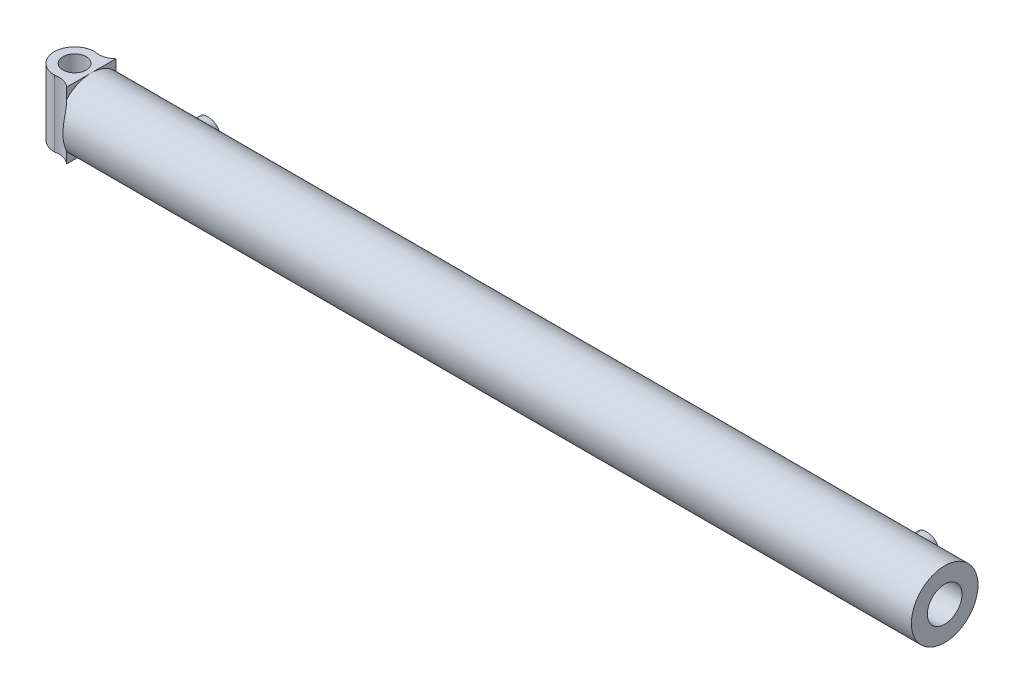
ISO-10303-21;
HEADER;
FILE_DESCRIPTION(('STEP AP214'),'2;1');
FILE_NAME('part.step','',(''),(''),'','','');
FILE_SCHEMA(('AUTOMOTIVE_DESIGN { 1 0 10303 214 1 1 1 1 }'));
ENDSEC;
DATA;
#1=APPLICATION_CONTEXT('core data for automotive mechanical design processes');
#2=APPLICATION_PROTOCOL_DEFINITION('international standard','automotive_design',2000,#1);
#3=PRODUCT_CONTEXT('',#1,'mechanical');
#4=PRODUCT('Part','Part','',(#3));
#5=PRODUCT_RELATED_PRODUCT_CATEGORY('part','',(#4));
#6=PRODUCT_DEFINITION_FORMATION('','',#4);
#7=PRODUCT_DEFINITION_CONTEXT('part definition',#1,'design');
#8=PRODUCT_DEFINITION('design','',#6,#7);
#9=PRODUCT_DEFINITION_SHAPE('','',#8);
#10=(LENGTH_UNIT() NAMED_UNIT(*) SI_UNIT(.MILLI.,.METRE.));
#11=(NAMED_UNIT(*) PLANE_ANGLE_UNIT() SI_UNIT($,.RADIAN.));
#12=(NAMED_UNIT(*) SI_UNIT($,.STERADIAN.) SOLID_ANGLE_UNIT());
#13=UNCERTAINTY_MEASURE_WITH_UNIT(LENGTH_MEASURE(1.E-05),#10,'distance_accuracy_value','');
#14=(GEOMETRIC_REPRESENTATION_CONTEXT(3) GLOBAL_UNCERTAINTY_ASSIGNED_CONTEXT((#13)) GLOBAL_UNIT_ASSIGNED_CONTEXT((#10,
#11,#12)) REPRESENTATION_CONTEXT('',''));
#15=CARTESIAN_POINT('',(0.,0.,0.));
#16=DIRECTION('',(0.,0.,1.));
#17=DIRECTION('',(1.,0.,0.));
#18=AXIS2_PLACEMENT_3D('',#15,#16,#17);
#19=CARTESIAN_POINT('',(-5.64730137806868,36.576,36.6576836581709));
#20=DIRECTION('',(1.,0.,0.));
#21=DIRECTION('',(0.,0.,-1.));
#22=AXIS2_PLACEMENT_3D('',#19,#20,#21);
#23=CYLINDRICAL_SURFACE('',#22,36.576);
#24=CARTESIAN_POINT('',(85.9789990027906,36.5712254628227,0.0816839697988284));
#25=CARTESIAN_POINT('',(85.979127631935,36.8836420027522,0.0816421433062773));
#26=CARTESIAN_POINT('',(85.9660870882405,37.1960439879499,0.0856141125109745));
#27=CARTESIAN_POINT('',(85.9145057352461,37.8185525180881,0.101469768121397));
#28=CARTESIAN_POINT('',(85.8759625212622,38.128658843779,0.113354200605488));
#29=CARTESIAN_POINT('',(85.7740684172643,38.744413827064,0.144715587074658));
#30=CARTESIAN_POINT('',(85.7107131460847,39.0500616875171,0.164193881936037));
#31=CARTESIAN_POINT('',(85.5596948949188,39.6547542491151,0.210229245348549));
#32=CARTESIAN_POINT('',(85.4720347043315,39.9537997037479,0.236785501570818));
#33=CARTESIAN_POINT('',(85.322641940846,40.3956726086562,0.28137495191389));
#34=CARTESIAN_POINT('',(85.2698682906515,40.5418299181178,0.297028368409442));
#35=CARTESIAN_POINT('',(85.1583320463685,40.8316832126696,0.329812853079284));
#36=CARTESIAN_POINT('',(85.0995694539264,40.9753791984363,0.346943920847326));
#37=CARTESIAN_POINT('',(84.9762491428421,41.2601097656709,0.382575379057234));
#38=CARTESIAN_POINT('',(84.9116906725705,41.4011439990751,0.401075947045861));
#39=CARTESIAN_POINT('',(84.776955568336,41.6803203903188,0.439324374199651));
#40=CARTESIAN_POINT('',(84.7067789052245,41.8184625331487,0.45907223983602));
#41=CARTESIAN_POINT('',(84.4882569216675,42.2278247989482,0.519938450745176));
#42=CARTESIAN_POINT('',(84.3317057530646,42.4944735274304,0.56274175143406));
#43=CARTESIAN_POINT('',(83.9980038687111,43.0137640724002,0.651734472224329));
#44=CARTESIAN_POINT('',(83.8208608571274,43.2664110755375,0.697922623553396));
#45=CARTESIAN_POINT('',(83.4800911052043,43.7130310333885,0.784173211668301));
#46=CARTESIAN_POINT('',(83.319613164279,43.9094794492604,0.823874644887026));
#47=CARTESIAN_POINT('',(83.0694649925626,44.1957144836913,0.884044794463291));
#48=CARTESIAN_POINT('',(82.9845108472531,44.2897194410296,0.904204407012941));
#49=CARTESIAN_POINT('',(82.8114950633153,44.4748356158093,0.944644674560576));
#50=CARTESIAN_POINT('',(82.7234326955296,44.5659461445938,0.964925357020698));
#51=CARTESIAN_POINT('',(82.4083740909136,44.8812908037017,1.0363494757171));
#52=CARTESIAN_POINT('',(82.1734091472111,45.0976486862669,1.08760723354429));
#53=CARTESIAN_POINT('',(81.6860051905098,45.5101376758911,1.18896345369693));
#54=CARTESIAN_POINT('',(81.4335594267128,45.7062608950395,1.23906145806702));
#55=CARTESIAN_POINT('',(80.912226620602,46.0771010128,1.33673095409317));
#56=CARTESIAN_POINT('',(80.6433106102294,46.2517784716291,1.38429770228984));
#57=CARTESIAN_POINT('',(80.091168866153,46.5780738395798,1.47542943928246));
#58=CARTESIAN_POINT('',(79.8079442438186,46.7296935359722,1.51899473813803));
#59=CARTESIAN_POINT('',(79.3737693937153,46.9391201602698,1.58041457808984));
#60=CARTESIAN_POINT('',(79.2273922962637,47.0059652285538,1.60024450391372));
#61=CARTESIAN_POINT('',(78.9318090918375,47.1335346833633,1.6384508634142));
#62=CARTESIAN_POINT('',(78.7826029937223,47.1942590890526,1.65682730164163));
#63=CARTESIAN_POINT('',(78.3311028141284,47.3669540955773,1.70952736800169));
#64=CARTESIAN_POINT('',(78.024845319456,47.4694858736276,1.74143342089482));
#65=CARTESIAN_POINT('',(77.404368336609,47.6483270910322,1.79773333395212));
#66=CARTESIAN_POINT('',(77.0901547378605,47.7246553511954,1.82213258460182));
#67=CARTESIAN_POINT('',(76.4558672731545,47.8504795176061,1.8626514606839));
#68=CARTESIAN_POINT('',(76.1357934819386,47.8999757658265,1.87877119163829));
#69=CARTESIAN_POINT('',(75.5026904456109,47.9704571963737,1.90179974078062));
#70=CARTESIAN_POINT('',(75.1897697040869,47.9923155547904,1.90899051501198));
#71=CARTESIAN_POINT('',(74.7198633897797,48.0058060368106,1.91342805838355));
#72=CARTESIAN_POINT('',(74.563127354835,48.0070859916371,1.91384890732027));
#73=CARTESIAN_POINT('',(74.2497471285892,48.003100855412,1.91253800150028));
#74=CARTESIAN_POINT('',(74.0931029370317,47.9978357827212,1.91080625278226));
#75=CARTESIAN_POINT('',(73.6237698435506,47.9723286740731,1.90242711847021));
#76=CARTESIAN_POINT('',(73.3116097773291,47.9423767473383,1.89259649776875));
#77=CARTESIAN_POINT('',(72.6911401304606,47.85721292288,1.86486841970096));
#78=CARTESIAN_POINT('',(72.38283090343,47.8019987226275,1.84697022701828));
#79=CARTESIAN_POINT('',(71.7792279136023,47.6684370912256,1.80418439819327));
#80=CARTESIAN_POINT('',(71.4837978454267,47.5906499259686,1.77946668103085));
#81=CARTESIAN_POINT('',(70.9006402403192,47.4119757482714,1.7235431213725));
#82=CARTESIAN_POINT('',(70.6129116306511,47.3110919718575,1.69233818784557));
#83=CARTESIAN_POINT('',(70.1886593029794,47.1427289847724,1.64123852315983));
#84=CARTESIAN_POINT('',(70.0484440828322,47.0837579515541,1.62348683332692));
#85=CARTESIAN_POINT('',(69.7706592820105,46.9602521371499,1.5866808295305));
#86=CARTESIAN_POINT('',(69.6330897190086,46.8957173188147,1.5676265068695));
#87=CARTESIAN_POINT('',(69.2245957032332,46.6940324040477,1.50873167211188));
#88=CARTESIAN_POINT('',(68.9578645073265,46.5487933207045,1.46715667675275));
#89=CARTESIAN_POINT('',(68.429086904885,46.2332527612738,1.37923576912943));
#90=CARTESIAN_POINT('',(68.1674386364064,46.0623165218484,1.33278226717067));
#91=CARTESIAN_POINT('',(67.6591258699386,45.7000664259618,1.23748804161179));
#92=CARTESIAN_POINT('',(67.4124606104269,45.5087536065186,1.1886474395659));
#93=CARTESIAN_POINT('',(66.9356451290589,45.1066811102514,1.08980305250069));
#94=CARTESIAN_POINT('',(66.7054992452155,44.8959163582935,1.0397989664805));
#95=CARTESIAN_POINT('',(66.2635262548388,44.4559523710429,0.939887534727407));
#96=CARTESIAN_POINT('',(66.0516997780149,44.2267525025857,0.889980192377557));
#97=CARTESIAN_POINT('',(65.6392368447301,43.7421178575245,0.789672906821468));
#98=CARTESIAN_POINT('',(65.4393878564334,43.4860001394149,0.739333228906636));
#99=CARTESIAN_POINT('',(65.0617775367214,42.9574161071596,0.641665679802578));
#100=CARTESIAN_POINT('',(64.8840175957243,42.684948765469,0.594337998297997));
#101=CARTESIAN_POINT('',(64.5518821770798,42.1253054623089,0.503993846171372));
#102=CARTESIAN_POINT('',(64.3975105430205,41.8381270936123,0.460978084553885));
#103=CARTESIAN_POINT('',(64.1846925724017,41.3978341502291,0.400606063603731));
#104=CARTESIAN_POINT('',(64.1168720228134,41.2494705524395,0.381172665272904));
#105=CARTESIAN_POINT('',(63.9876596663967,40.9497830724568,0.343821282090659));
#106=CARTESIAN_POINT('',(63.9262678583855,40.7984591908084,0.325903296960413));
#107=CARTESIAN_POINT('',(63.7532506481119,40.3441891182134,0.275043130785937));
#108=CARTESIAN_POINT('',(63.6510369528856,40.0373230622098,0.244493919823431));
#109=CARTESIAN_POINT('',(63.4728219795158,39.4154459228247,0.190729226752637));
#110=CARTESIAN_POINT('',(63.3968233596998,39.1004340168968,0.16751448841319));
#111=CARTESIAN_POINT('',(63.2717866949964,38.464995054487,0.129110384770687));
#112=CARTESIAN_POINT('',(63.2227175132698,38.1445746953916,0.113911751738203));
#113=CARTESIAN_POINT('',(63.1519498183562,37.5004978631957,0.0919507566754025));
#114=CARTESIAN_POINT('',(63.1302431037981,37.1768423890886,0.0851858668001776));
#115=CARTESIAN_POINT('',(63.1172340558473,36.6418093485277,0.0811326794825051));
#116=CARTESIAN_POINT('',(63.117972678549,36.4306075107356,0.081363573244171));
#117=CARTESIAN_POINT('',(63.1311220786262,36.0086369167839,0.0854761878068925));
#118=CARTESIAN_POINT('',(63.1435302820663,35.797868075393,0.0893571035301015));
#119=CARTESIAN_POINT('',(63.1799911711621,35.377439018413,0.100721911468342));
#120=CARTESIAN_POINT('',(63.2040438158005,35.1677787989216,0.108205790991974));
#121=CARTESIAN_POINT('',(63.2636936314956,34.750256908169,0.12668137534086));
#122=CARTESIAN_POINT('',(63.2992917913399,34.5423953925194,0.137673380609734));
#123=CARTESIAN_POINT('',(63.403188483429,34.0226162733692,0.169571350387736));
#124=CARTESIAN_POINT('',(63.478884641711,33.7122825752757,0.19266710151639));
#125=CARTESIAN_POINT('',(63.6558125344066,33.0995266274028,0.245974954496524));
#126=CARTESIAN_POINT('',(63.7570504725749,32.7971063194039,0.27618878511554));
#127=CARTESIAN_POINT('',(63.9273595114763,32.3509289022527,0.326223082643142));
#128=CARTESIAN_POINT('',(63.987253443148,32.2033435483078,0.343700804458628));
#129=CARTESIAN_POINT('',(64.1131501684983,31.9109850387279,0.380099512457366));
#130=CARTESIAN_POINT('',(64.1791528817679,31.7662118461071,0.399020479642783));
#131=CARTESIAN_POINT('',(64.3860568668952,31.3364760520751,0.457756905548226));
#132=CARTESIAN_POINT('',(64.5358829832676,31.0560213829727,0.499554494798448));
#133=CARTESIAN_POINT('',(64.857510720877,30.5096007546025,0.587210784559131));
#134=CARTESIAN_POINT('',(65.029262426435,30.2436037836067,0.633060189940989));
#135=CARTESIAN_POINT('',(65.3937771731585,29.7269799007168,0.727700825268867));
#136=CARTESIAN_POINT('',(65.5865401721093,29.4763529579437,0.776492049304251));
#137=CARTESIAN_POINT('',(65.9919437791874,28.9920606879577,0.875722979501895));
#138=CARTESIAN_POINT('',(66.2045823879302,28.7583936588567,0.926162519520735));
#139=CARTESIAN_POINT('',(66.5376359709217,28.4219904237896,1.00198082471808));
#140=CARTESIAN_POINT('',(66.6510147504,28.312195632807,1.02728254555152));
#141=CARTESIAN_POINT('',(66.8822953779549,28.0974500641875,1.07777177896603));
#142=CARTESIAN_POINT('',(67.0001972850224,27.9924993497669,1.10295929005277));
#143=CARTESIAN_POINT('',(67.3662226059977,27.6800330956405,1.17934839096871));
#144=CARTESIAN_POINT('',(67.6212347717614,27.4803890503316,1.23012828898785));
#145=CARTESIAN_POINT('',(68.1474015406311,27.1029799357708,1.32917182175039));
#146=CARTESIAN_POINT('',(68.4185579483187,26.9252173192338,1.37743517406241));
#147=CARTESIAN_POINT('',(68.9754863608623,26.5927896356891,1.47005704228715));
#148=CARTESIAN_POINT('',(69.2612617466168,26.4381299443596,1.51441464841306));
#149=CARTESIAN_POINT('',(69.6994364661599,26.2247407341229,1.57690982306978));
#150=CARTESIAN_POINT('',(69.8470849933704,26.1567091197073,1.59706860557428));
#151=CARTESIAN_POINT('',(70.1453847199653,26.0270709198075,1.63585543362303));
#152=CARTESIAN_POINT('',(70.2960358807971,25.965464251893,1.65448349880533));
#153=CARTESIAN_POINT('',(70.598883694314,25.8492614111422,1.68991963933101));
#154=CARTESIAN_POINT('',(70.75105956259,25.794614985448,1.7067406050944));
#155=CARTESIAN_POINT('',(71.0577539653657,25.6917957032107,1.73862353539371));
#156=CARTESIAN_POINT('',(71.2122725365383,25.6436229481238,1.75368547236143));
#157=CARTESIAN_POINT('',(71.6789716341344,25.5088700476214,1.79608082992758));
#158=CARTESIAN_POINT('',(71.9942972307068,25.4320546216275,1.82062399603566));
#159=CARTESIAN_POINT('',(72.6303499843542,25.305111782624,1.86148733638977));
#160=CARTESIAN_POINT('',(72.9510703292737,25.2549529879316,1.87781717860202));
#161=CARTESIAN_POINT('',(73.5958857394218,25.1818991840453,1.9016805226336));
#162=CARTESIAN_POINT('',(73.9199792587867,25.1589921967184,1.9092178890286));
#163=CARTESIAN_POINT('',(74.3510847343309,25.1472469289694,1.91308173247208));
#164=CARTESIAN_POINT('',(74.4578253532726,25.1458620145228,1.91353714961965));
#165=CARTESIAN_POINT('',(74.6712978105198,25.1461603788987,1.91343884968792));
#166=CARTESIAN_POINT('',(74.7780296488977,25.1478434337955,1.91288520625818));
#167=CARTESIAN_POINT('',(75.0980453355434,25.1573927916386,1.90974500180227));
#168=CARTESIAN_POINT('',(75.3111949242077,25.1697580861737,1.90567956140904));
#169=CARTESIAN_POINT('',(75.7363710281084,25.2062231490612,1.89373222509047));
#170=CARTESIAN_POINT('',(75.9483975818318,25.2303225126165,1.88585046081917));
#171=CARTESIAN_POINT('',(76.2650534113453,25.2752421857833,1.87123673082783));
#172=CARTESIAN_POINT('',(76.370385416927,25.2916793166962,1.86589961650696));
#173=CARTESIAN_POINT('',(76.5804915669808,25.3275188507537,1.85429584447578));
#174=CARTESIAN_POINT('',(76.6852657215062,25.3469212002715,1.84802920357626));
#175=CARTESIAN_POINT('',(76.9462692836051,25.3990553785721,1.83124588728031));
#176=CARTESIAN_POINT('',(77.1021028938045,25.4336093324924,1.82016820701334));
#177=CARTESIAN_POINT('',(77.4120143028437,25.5091372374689,1.79610179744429));
#178=CARTESIAN_POINT('',(77.5660923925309,25.550110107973,1.78311338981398));
#179=CARTESIAN_POINT('',(78.0254052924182,25.6826751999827,1.74138544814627));
#180=CARTESIAN_POINT('',(78.3276723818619,25.7839046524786,1.70988621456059));
#181=CARTESIAN_POINT('',(78.9223834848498,26.0109701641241,1.64057341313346));
#182=CARTESIAN_POINT('',(79.2148164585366,26.1368328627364,1.60275301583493));
#183=CARTESIAN_POINT('',(79.787622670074,26.4121591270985,1.52193710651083));
#184=CARTESIAN_POINT('',(80.0679956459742,26.561623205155,1.47894148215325));
#185=CARTESIAN_POINT('',(80.6142646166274,26.8827103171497,1.38911938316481));
#186=CARTESIAN_POINT('',(80.8801906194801,27.0542847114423,1.34230139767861));
#187=CARTESIAN_POINT('',(81.3965846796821,27.4186425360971,1.24607428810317));
#188=CARTESIAN_POINT('',(81.6470523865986,27.6114264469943,1.19666510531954));
#189=CARTESIAN_POINT('',(82.1310278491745,28.0169103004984,1.09661881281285));
#190=CARTESIAN_POINT('',(82.3645383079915,28.2296070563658,1.04598190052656));
#191=CARTESIAN_POINT('',(82.7009533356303,28.5625590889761,0.970129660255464));
#192=CARTESIAN_POINT('',(82.8107931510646,28.6758725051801,0.944860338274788));
#193=CARTESIAN_POINT('',(83.0256751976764,28.907007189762,0.894513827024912));
#194=CARTESIAN_POINT('',(83.1307172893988,29.0248285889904,0.869436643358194));
#195=CARTESIAN_POINT('',(83.4438142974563,29.3910199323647,0.793453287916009));
#196=CARTESIAN_POINT('',(83.6439866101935,29.6463319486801,0.743128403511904));
#197=CARTESIAN_POINT('',(84.0222552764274,30.1733312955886,0.645443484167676));
#198=CARTESIAN_POINT('',(84.2003503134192,30.4450196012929,0.598083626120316));
#199=CARTESIAN_POINT('',(84.5331978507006,31.0031181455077,0.50762566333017));
#200=CARTESIAN_POINT('',(84.6879443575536,31.2895321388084,0.464528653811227));
#201=CARTESIAN_POINT('',(84.972671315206,31.8752046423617,0.383813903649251));
#202=CARTESIAN_POINT('',(85.1026532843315,32.1744623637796,0.346195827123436));
#203=CARTESIAN_POINT('',(85.2816177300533,32.6413758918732,0.293563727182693));
#204=CARTESIAN_POINT('',(85.340070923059,32.8051942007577,0.27620030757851));
#205=CARTESIAN_POINT('',(85.4494717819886,33.1354677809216,0.243482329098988));
#206=CARTESIAN_POINT('',(85.5004212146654,33.3019224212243,0.22812729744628));
#207=CARTESIAN_POINT('',(85.6419650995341,33.8048544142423,0.185261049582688));
#208=CARTESIAN_POINT('',(85.7212449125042,34.1448730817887,0.160951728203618));
#209=CARTESIAN_POINT('',(85.8488929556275,34.831016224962,0.121716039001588));
#210=CARTESIAN_POINT('',(85.897272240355,35.177138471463,0.106786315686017));
#211=CARTESIAN_POINT('',(85.9622483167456,35.8725890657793,0.0867952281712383));
#212=CARTESIAN_POINT('',(85.9788551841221,36.2219163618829,0.0817307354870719));
#213=CARTESIAN_POINT('',(85.9789990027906,36.5712254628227,0.0816839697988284));
#214=B_SPLINE_CURVE_WITH_KNOTS('',3,(#24,#25,#26,#27,#28,#29,#30,#31,#32,#33,#34,#35,#36,#37,
#38,#39,#40,#41,#42,#43,#44,#45,#46,#47,#48,#49,#50,#51,#52,#53,#54,#55,#56,#57,#58,#59,#60,#61,
#62,#63,#64,#65,#66,#67,#68,#69,#70,#71,#72,#73,#74,#75,#76,#77,#78,#79,#80,#81,#82,#83,#84,#85,
#86,#87,#88,#89,#90,#91,#92,#93,#94,#95,#96,#97,#98,#99,#100,#101,#102,#103,#104,#105,#106,#107,
#108,#109,#110,#111,#112,#113,#114,#115,#116,#117,#118,#119,#120,#121,#122,#123,#124,#125,#126,
#127,#128,#129,#130,#131,#132,#133,#134,#135,#136,#137,#138,#139,#140,#141,#142,#143,#144,#145,
#146,#147,#148,#149,#150,#151,#152,#153,#154,#155,#156,#157,#158,#159,#160,#161,#162,#163,#164,
#165,#166,#167,#168,#169,#170,#171,#172,#173,#174,#175,#176,#177,#178,#179,#180,#181,#182,#183,
#184,#185,#186,#187,#188,#189,#190,#191,#192,#193,#194,#195,#196,#197,#198,#199,#200,#201,#202,
#203,#204,#205,#206,#207,#208,#209,#210,#211,#212,#213),.UNSPECIFIED.,.T.,.F.,(4,2,2,2,2,2,2,2,
2,2,2,2,2,2,2,2,2,2,2,2,2,2,2,2,2,2,2,2,2,2,2,2,2,2,2,2,2,2,2,2,2,2,2,2,2,2,2,2,2,2,2,2,2,2,2,2,
2,2,2,2,2,2,2,2,2,2,2,2,2,2,2,2,2,2,2,2,2,2,2,2,2,2,2,2,2,2,2,2,2,2,2,2,2,2,4),(0.,
0.936932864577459,1.87395408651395,2.81114083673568,3.74822007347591,4.21664307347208,
4.68506594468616,5.15354965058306,5.62203578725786,6.55739062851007,7.49239663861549,
8.2620688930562,8.64690111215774,9.03182421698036,10.001086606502,10.9707254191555,
11.9421215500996,12.9134423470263,13.3997201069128,13.8859963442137,14.8582758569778,
15.8298555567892,16.8014228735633,17.7414585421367,18.2115546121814,18.6816493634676,
19.6216275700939,20.5616914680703,21.480170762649,22.3985214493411,22.8578395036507,
23.3171606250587,24.2357334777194,25.1826337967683,26.129485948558,27.0765858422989,
28.0237182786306,29.0087678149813,29.9938793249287,30.9791525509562,31.4718645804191,
31.964576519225,32.9378872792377,33.9112967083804,34.8835782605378,35.8555683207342,
36.4888550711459,37.1220021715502,37.7551470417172,38.3883461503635,39.3478884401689,
40.3076640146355,40.788231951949,41.268793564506,42.2296726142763,43.1884018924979,
44.1471292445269,45.1057602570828,45.5851684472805,46.064582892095,47.04679760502,
48.0291223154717,49.0116752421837,49.5029840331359,49.9942865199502,50.4818120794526,
50.9693452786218,51.9444062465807,52.9183167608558,53.8917990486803,54.2120171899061,
54.5322119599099,55.1724649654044,55.8126958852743,56.1328770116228,56.4530523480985,
56.9328932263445,57.4126534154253,58.3723153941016,59.3330209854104,60.2937474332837,
61.252395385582,62.2110650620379,63.1695815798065,63.6489322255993,64.1282967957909,
65.1119593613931,66.0956805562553,67.0796538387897,68.0635667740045,68.5877877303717,
69.1118850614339,70.1601658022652,71.2080713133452,72.2556444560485),.UNSPECIFIED.);
#215=CARTESIAN_POINT('',(85.9789990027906,36.5712254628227,0.0816839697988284));
#216=VERTEX_POINT('',#215);
#217=EDGE_CURVE('E49',#216,#216,#214,.T.);
#218=ORIENTED_EDGE('',*,*,#217,.T.);
#219=EDGE_LOOP('',(#218));
#220=FACE_BOUND('',#219,.T.);
#221=CARTESIAN_POINT('',(931.612698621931,36.576,36.6576836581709));
#222=DIRECTION('',(1.,0.,0.));
#223=DIRECTION('',(0.,0.,-1.));
#224=AXIS2_PLACEMENT_3D('',#221,#222,#223);
#225=CIRCLE('',#224,36.576);
#226=CARTESIAN_POINT('',(931.612698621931,36.576,0.0816836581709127));
#227=VERTEX_POINT('',#226);
#228=EDGE_CURVE('E106',#227,#227,#225,.T.);
#229=ORIENTED_EDGE('',*,*,#228,.F.);
#230=EDGE_LOOP('',(#229));
#231=FACE_BOUND('',#230,.T.);
#232=CARTESIAN_POINT('',(-5.64730137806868,11.9029162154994,9.65689269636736));
#233=CARTESIAN_POINT('',(-5.46046087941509,12.0949665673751,9.4813825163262));
#234=CARTESIAN_POINT('',(-5.27991205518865,12.2922126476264,9.30491675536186));
#235=CARTESIAN_POINT('',(-4.9312057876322,12.6965921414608,8.95119401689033));
#236=CARTESIAN_POINT('',(-4.76304559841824,12.9037233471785,8.77393722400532));
#237=CARTESIAN_POINT('',(-4.43913002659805,13.32707801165,8.41998835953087));
#238=CARTESIAN_POINT('',(-4.28335311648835,13.5432846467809,8.2432958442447));
#239=CARTESIAN_POINT('',(-3.98352823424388,13.9846365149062,7.89114340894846));
#240=CARTESIAN_POINT('',(-3.83948089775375,14.2097822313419,7.71568355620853));
#241=CARTESIAN_POINT('',(-3.42707564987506,14.8933517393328,7.19598747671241));
#242=CARTESIAN_POINT('',(-3.17520824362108,15.3641952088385,6.85483080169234));
#243=CARTESIAN_POINT('',(-2.7119853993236,16.3353402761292,6.18692462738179));
#244=CARTESIAN_POINT('',(-2.50065163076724,16.8356574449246,5.8601829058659));
#245=CARTESIAN_POINT('',(-2.18615550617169,17.6709253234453,5.3440187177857));
#246=CARTESIAN_POINT('',(-2.07199221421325,17.9981833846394,5.14871555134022));
#247=CARTESIAN_POINT('',(-1.85687335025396,18.6619245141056,4.76667609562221));
#248=CARTESIAN_POINT('',(-1.75591866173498,18.9984081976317,4.57994037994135));
#249=CARTESIAN_POINT('',(-1.47121964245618,20.020478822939,4.03384910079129));
#250=CARTESIAN_POINT('',(-1.30561083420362,20.7187656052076,3.68855962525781));
#251=CARTESIAN_POINT('',(-1.01398083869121,22.1452951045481,3.03960284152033));
#252=CARTESIAN_POINT('',(-0.888104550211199,22.8736367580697,2.73609010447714));
#253=CARTESIAN_POINT('',(-0.669148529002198,24.3526877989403,2.17551666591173));
#254=CARTESIAN_POINT('',(-0.576067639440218,25.1033963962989,1.91845432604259));
#255=CARTESIAN_POINT('',(-0.414578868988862,26.638458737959,1.44820974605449));
#256=CARTESIAN_POINT('',(-0.346731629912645,27.4231880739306,1.23606514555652));
#257=CARTESIAN_POINT('',(-0.232978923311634,29.0065118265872,0.864277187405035));
#258=CARTESIAN_POINT('',(-0.187073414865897,29.8051062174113,0.704633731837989));
#259=CARTESIAN_POINT('',(-0.113080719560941,31.4115046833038,0.438982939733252));
#260=CARTESIAN_POINT('',(-0.084984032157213,32.2193036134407,0.33294701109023));
#261=CARTESIAN_POINT('',(-0.0438159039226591,33.8406673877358,0.175015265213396));
#262=CARTESIAN_POINT('',(-0.0307455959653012,34.6542326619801,0.123123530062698));
#263=CARTESIAN_POINT('',(-0.0208332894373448,35.9545452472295,0.083729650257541));
#264=CARTESIAN_POINT('',(-0.0195728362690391,36.4408015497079,0.0787015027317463));
#265=CARTESIAN_POINT('',(-0.0219137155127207,37.4131527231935,0.0880338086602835));
#266=CARTESIAN_POINT('',(-0.0255151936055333,37.899247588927,0.102394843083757));
#267=CARTESIAN_POINT('',(-0.0377079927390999,38.8704904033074,0.15048499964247));
#268=CARTESIAN_POINT('',(-0.0463001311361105,39.3556381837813,0.184217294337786));
#269=CARTESIAN_POINT('',(-0.0687866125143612,40.3240791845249,0.270982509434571));
#270=CARTESIAN_POINT('',(-0.0826809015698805,40.8073724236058,0.324015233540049));
#271=CARTESIAN_POINT('',(-0.116275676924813,41.7717216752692,0.449329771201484));
#272=CARTESIAN_POINT('',(-0.135981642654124,42.2527751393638,0.521629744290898));
#273=CARTESIAN_POINT('',(-0.181863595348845,43.2113247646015,0.685296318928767));
#274=CARTESIAN_POINT('',(-0.208039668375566,43.6888208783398,0.776663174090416));
#275=CARTESIAN_POINT('',(-0.267702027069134,44.639282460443,0.978233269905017));
#276=CARTESIAN_POINT('',(-0.301187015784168,45.1122487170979,1.08843316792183));
#277=CARTESIAN_POINT('',(-0.376492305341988,46.0527601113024,1.32738113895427));
#278=CARTESIAN_POINT('',(-0.418312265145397,46.5203054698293,1.45612845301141));
#279=CARTESIAN_POINT('',(-0.541467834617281,47.7481119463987,1.82061394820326));
#280=CARTESIAN_POINT('',(-0.630910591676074,48.5030455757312,2.07187168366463));
#281=CARTESIAN_POINT('',(-0.841798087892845,49.9910077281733,2.62137501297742));
#282=CARTESIAN_POINT('',(-0.963241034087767,50.7240374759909,2.91961797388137));
#283=CARTESIAN_POINT('',(-1.2450022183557,52.1598838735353,3.5584246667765));
#284=CARTESIAN_POINT('',(-1.4051483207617,52.8628185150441,3.89879783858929));
#285=CARTESIAN_POINT('',(-1.77291972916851,54.2359154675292,4.61815625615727));
#286=CARTESIAN_POINT('',(-1.980540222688,54.9060810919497,4.997137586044));
#287=CARTESIAN_POINT('',(-2.41102718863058,56.0937149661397,5.71809600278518));
#288=CARTESIAN_POINT('',(-2.62496731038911,56.6174739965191,6.05505119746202));
#289=CARTESIAN_POINT('',(-3.09610648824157,57.6337180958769,6.7452641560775));
#290=CARTESIAN_POINT('',(-3.35328091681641,58.1262207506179,7.09851255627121));
#291=CARTESIAN_POINT('',(-3.77628392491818,58.8409739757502,7.63759638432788));
#292=CARTESIAN_POINT('',(-3.92444710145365,59.0765002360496,7.81989453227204));
#293=CARTESIAN_POINT('',(-4.23342097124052,59.5379424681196,8.1859499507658));
#294=CARTESIAN_POINT('',(-4.39423090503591,59.7638590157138,8.3697071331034));
#295=CARTESIAN_POINT('',(-4.72922289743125,60.2059542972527,8.73794309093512));
#296=CARTESIAN_POINT('',(-4.9034306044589,60.4221130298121,8.92242257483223));
#297=CARTESIAN_POINT('',(-5.2652516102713,60.8437532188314,9.29057656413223));
#298=CARTESIAN_POINT('',(-5.45286824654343,61.04923199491,9.47425085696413));
#299=CARTESIAN_POINT('',(-5.64730137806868,61.2490837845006,9.65689269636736));
#300=B_SPLINE_CURVE_WITH_KNOTS('',3,(#232,#233,#234,#235,#236,#237,#238,#239,#240,#241,#242,
#243,#244,#245,#246,#247,#248,#249,#250,#251,#252,#253,#254,#255,#256,#257,#258,#259,#260,#261,
#262,#263,#264,#265,#266,#267,#268,#269,#270,#271,#272,#273,#274,#275,#276,#277,#278,#279,#280,
#281,#282,#283,#284,#285,#286,#287,#288,#289,#290,#291,#292,#293,#294,#295,#296,#297,#298,#299),
.UNSPECIFIED.,.F.,.F.,(4,2,2,2,2,2,2,2,2,2,2,2,2,2,2,2,2,2,2,2,2,2,2,2,2,2,2,2,2,2,2,2,2,4),(0.,
0.960769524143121,1.92132545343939,2.88017324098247,3.83907295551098,5.7375232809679,
7.63698571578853,8.83009537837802,10.0232848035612,12.4093678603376,14.8040546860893,
17.1986570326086,19.6436683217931,22.0886750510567,24.532376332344,26.9762618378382,
28.4347540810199,29.8932900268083,31.3520649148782,32.810824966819,34.2709648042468,
35.7311240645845,37.1910244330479,38.650865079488,41.0505059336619,43.450012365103,
45.8390370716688,48.2278197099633,50.2012919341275,52.1736437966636,53.171285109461,
54.1688665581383,55.1684077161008,56.1681985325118),.UNSPECIFIED.);
#301=CARTESIAN_POINT('',(-5.64730137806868,11.9029162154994,9.65689269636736));
#302=VERTEX_POINT('',#301);
#303=CARTESIAN_POINT('',(-5.64730137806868,61.2490837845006,9.65689269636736));
#304=VERTEX_POINT('',#303);
#305=EDGE_CURVE('E169',#302,#304,#300,.T.);
#306=ORIENTED_EDGE('',*,*,#305,.T.);
#307=CARTESIAN_POINT('',(-5.64730137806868,36.576,36.6576836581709));
#308=DIRECTION('',(1.,0.,0.));
#309=DIRECTION('',(0.,0.,-1.));
#310=AXIS2_PLACEMENT_3D('',#307,#308,#309);
#311=CIRCLE('',#310,36.576);
#312=CARTESIAN_POINT('',(-5.64730137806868,73.152,36.6576836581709));
#313=VERTEX_POINT('',#312);
#314=EDGE_CURVE('E166',#304,#313,#311,.T.);
#315=ORIENTED_EDGE('',*,*,#314,.T.);
#316=CARTESIAN_POINT('',(-5.64730137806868,61.2490837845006,63.6584746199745));
#317=VERTEX_POINT('',#316);
#318=EDGE_CURVE('E170',#313,#317,#311,.T.);
#319=ORIENTED_EDGE('',*,*,#318,.T.);
#320=CARTESIAN_POINT('',(-5.64730137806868,11.9029162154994,63.6584746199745));
#321=CARTESIAN_POINT('',(-5.46046087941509,12.0949665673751,63.8339848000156));
#322=CARTESIAN_POINT('',(-5.27991205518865,12.2922126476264,64.01045056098));
#323=CARTESIAN_POINT('',(-4.9312057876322,12.6965921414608,64.3641732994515));
#324=CARTESIAN_POINT('',(-4.76304559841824,12.9037233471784,64.5414300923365));
#325=CARTESIAN_POINT('',(-4.43913002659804,13.32707801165,64.895378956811));
#326=CARTESIAN_POINT('',(-4.28335311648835,13.5432846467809,65.0720714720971));
#327=CARTESIAN_POINT('',(-3.98352823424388,13.9846365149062,65.4242239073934));
#328=CARTESIAN_POINT('',(-3.83948089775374,14.2097822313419,65.5996837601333));
#329=CARTESIAN_POINT('',(-3.42707564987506,14.8933517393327,66.1193798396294));
#330=CARTESIAN_POINT('',(-3.17520824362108,15.3641952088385,66.4605365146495));
#331=CARTESIAN_POINT('',(-2.71198539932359,16.3353402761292,67.12844268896));
#332=CARTESIAN_POINT('',(-2.50065163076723,16.8356574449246,67.4551844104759));
#333=CARTESIAN_POINT('',(-2.18615550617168,17.6709253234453,67.9713485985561));
#334=CARTESIAN_POINT('',(-2.07199221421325,17.9981833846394,68.1666517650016));
#335=CARTESIAN_POINT('',(-1.85687335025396,18.6619245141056,68.5486912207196));
#336=CARTESIAN_POINT('',(-1.75591866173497,18.9984081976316,68.7354269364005));
#337=CARTESIAN_POINT('',(-1.47121964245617,20.020478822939,69.2815182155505));
#338=CARTESIAN_POINT('',(-1.30561083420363,20.7187656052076,69.626807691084));
#339=CARTESIAN_POINT('',(-1.01398083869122,22.1452951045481,70.2757644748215));
#340=CARTESIAN_POINT('',(-0.888104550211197,22.8736367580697,70.5792772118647));
#341=CARTESIAN_POINT('',(-0.669148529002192,24.3526877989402,71.1398506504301));
#342=CARTESIAN_POINT('',(-0.576067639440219,25.1033963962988,71.3969129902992));
#343=CARTESIAN_POINT('',(-0.414578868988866,26.638458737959,71.8671575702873));
#344=CARTESIAN_POINT('',(-0.346731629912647,27.4231880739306,72.0793021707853));
#345=CARTESIAN_POINT('',(-0.232978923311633,29.0065118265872,72.4510901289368));
#346=CARTESIAN_POINT('',(-0.187073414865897,29.8051062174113,72.6107335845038));
#347=CARTESIAN_POINT('',(-0.11308071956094,31.4115046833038,72.8763843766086));
#348=CARTESIAN_POINT('',(-0.0849840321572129,32.2193036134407,72.9824203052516));
#349=CARTESIAN_POINT('',(-0.0438159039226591,33.8406673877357,73.1403520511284));
#350=CARTESIAN_POINT('',(-0.0307455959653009,34.65423266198,73.1922437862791));
#351=CARTESIAN_POINT('',(-0.0208332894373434,35.9545452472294,73.2316376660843));
#352=CARTESIAN_POINT('',(-0.0195728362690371,36.4408015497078,73.2366658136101));
#353=CARTESIAN_POINT('',(-0.0219137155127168,37.4131527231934,73.2273335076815));
#354=CARTESIAN_POINT('',(-0.0255151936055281,37.8992475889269,73.2129724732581));
#355=CARTESIAN_POINT('',(-0.0377079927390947,38.8704904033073,73.1648823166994));
#356=CARTESIAN_POINT('',(-0.0463001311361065,39.3556381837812,73.131150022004));
#357=CARTESIAN_POINT('',(-0.0687866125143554,40.3240791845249,73.0443848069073));
#358=CARTESIAN_POINT('',(-0.0826809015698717,40.8073724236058,72.9913520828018));
#359=CARTESIAN_POINT('',(-0.116275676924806,41.7717216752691,72.8660375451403));
#360=CARTESIAN_POINT('',(-0.135981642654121,42.2527751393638,72.7937375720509));
#361=CARTESIAN_POINT('',(-0.181863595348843,43.2113247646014,72.6300709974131));
#362=CARTESIAN_POINT('',(-0.208039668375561,43.6888208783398,72.5387041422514));
#363=CARTESIAN_POINT('',(-0.267702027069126,44.639282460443,72.3371340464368));
#364=CARTESIAN_POINT('',(-0.301187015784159,45.1122487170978,72.22693414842));
#365=CARTESIAN_POINT('',(-0.376492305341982,46.0527601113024,71.9879861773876));
#366=CARTESIAN_POINT('',(-0.418312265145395,46.5203054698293,71.8592388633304));
#367=CARTESIAN_POINT('',(-0.54146783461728,47.7481119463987,71.4947533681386));
#368=CARTESIAN_POINT('',(-0.630910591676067,48.5030455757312,71.2434956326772));
#369=CARTESIAN_POINT('',(-0.841798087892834,49.9910077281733,70.6939923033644));
#370=CARTESIAN_POINT('',(-0.963241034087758,50.7240374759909,70.3957493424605));
#371=CARTESIAN_POINT('',(-1.2450022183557,52.1598838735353,69.7569426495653));
#372=CARTESIAN_POINT('',(-1.4051483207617,52.8628185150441,69.4165694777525));
#373=CARTESIAN_POINT('',(-1.7729197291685,54.2359154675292,68.6972110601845));
#374=CARTESIAN_POINT('',(-1.98054022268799,54.9060810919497,68.3182297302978));
#375=CARTESIAN_POINT('',(-2.41102718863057,56.0937149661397,67.5972713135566));
#376=CARTESIAN_POINT('',(-2.6249673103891,56.6174739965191,67.2603161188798));
#377=CARTESIAN_POINT('',(-3.09610648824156,57.6337180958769,66.5701031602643));
#378=CARTESIAN_POINT('',(-3.3532809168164,58.1262207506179,66.2168547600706));
#379=CARTESIAN_POINT('',(-3.77628392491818,58.8409739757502,65.6777709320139));
#380=CARTESIAN_POINT('',(-3.92444710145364,59.0765002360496,65.4954727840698));
#381=CARTESIAN_POINT('',(-4.23342097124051,59.5379424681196,65.129417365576));
#382=CARTESIAN_POINT('',(-4.39423090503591,59.7638590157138,64.9456601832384));
#383=CARTESIAN_POINT('',(-4.72922289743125,60.2059542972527,64.5774242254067));
#384=CARTESIAN_POINT('',(-4.9034306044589,60.4221130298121,64.3929447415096));
#385=CARTESIAN_POINT('',(-5.2652516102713,60.8437532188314,64.0247907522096));
#386=CARTESIAN_POINT('',(-5.45286824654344,61.04923199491,63.8411164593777));
#387=CARTESIAN_POINT('',(-5.64730137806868,61.2490837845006,63.6584746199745));
#388=B_SPLINE_CURVE_WITH_KNOTS('',3,(#320,#321,#322,#323,#324,#325,#326,#327,#328,#329,#330,
#331,#332,#333,#334,#335,#336,#337,#338,#339,#340,#341,#342,#343,#344,#345,#346,#347,#348,#349,
#350,#351,#352,#353,#354,#355,#356,#357,#358,#359,#360,#361,#362,#363,#364,#365,#366,#367,#368,
#369,#370,#371,#372,#373,#374,#375,#376,#377,#378,#379,#380,#381,#382,#383,#384,#385,#386,#387),
.UNSPECIFIED.,.F.,.F.,(4,2,2,2,2,2,2,2,2,2,2,2,2,2,2,2,2,2,2,2,2,2,2,2,2,2,2,2,2,2,2,2,2,4),(0.,
0.960769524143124,1.92132545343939,2.88017324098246,3.83907295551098,5.7375232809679,
7.63698571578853,8.83009537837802,10.0232848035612,12.4093678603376,14.8040546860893,
17.1986570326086,19.6436683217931,22.0886750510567,24.532376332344,26.9762618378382,
28.4347540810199,29.8932900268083,31.3520649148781,32.810824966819,34.2709648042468,
35.7311240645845,37.1910244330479,38.650865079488,41.0505059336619,43.4500123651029,
45.8390370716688,48.2278197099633,50.2012919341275,52.1736437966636,53.171285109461,
54.1688665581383,55.1684077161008,56.1681985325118),.UNSPECIFIED.);
#389=CARTESIAN_POINT('',(-5.64730137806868,11.9029162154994,63.6584746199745));
#390=VERTEX_POINT('',#389);
#391=EDGE_CURVE('E176',#390,#317,#388,.T.);
#392=ORIENTED_EDGE('',*,*,#391,.F.);
#393=CARTESIAN_POINT('',(-5.64730137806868,0.,36.6576836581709));
#394=VERTEX_POINT('',#393);
#395=EDGE_CURVE('E398',#390,#394,#311,.T.);
#396=ORIENTED_EDGE('',*,*,#395,.T.);
#397=EDGE_CURVE('E162',#394,#302,#311,.T.);
#398=ORIENTED_EDGE('',*,*,#397,.T.);
#399=EDGE_LOOP('',(#306,#315,#319,#392,#396,#398));
#400=FACE_BOUND('',#399,.T.);
#401=CARTESIAN_POINT('',(875.029999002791,36.5712254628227,0.0816839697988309));
#402=CARTESIAN_POINT('',(875.030127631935,36.8836420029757,0.0816421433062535));
#403=CARTESIAN_POINT('',(875.017087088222,37.196043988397,0.0856141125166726));
#404=CARTESIAN_POINT('',(874.965505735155,37.8185525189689,0.101469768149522));
#405=CARTESIAN_POINT('',(874.926962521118,38.1286588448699,0.113354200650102));
#406=CARTESIAN_POINT('',(874.825068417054,38.7444138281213,0.14471558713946));
#407=CARTESIAN_POINT('',(874.761713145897,39.0500616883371,0.164193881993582));
#408=CARTESIAN_POINT('',(874.610694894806,39.6547542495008,0.210229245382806));
#409=CARTESIAN_POINT('',(874.523034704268,39.9537997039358,0.236785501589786));
#410=CARTESIAN_POINT('',(874.373641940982,40.395672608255,0.281374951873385));
#411=CARTESIAN_POINT('',(874.320868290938,40.5418299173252,0.297028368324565));
#412=CARTESIAN_POINT('',(874.20933204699,40.8316832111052,0.329812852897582));
#413=CARTESIAN_POINT('',(874.150569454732,40.9753791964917,0.346943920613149));
#414=CARTESIAN_POINT('',(874.027249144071,41.2601097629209,0.382575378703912));
#415=CARTESIAN_POINT('',(873.962690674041,41.4011439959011,0.401075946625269));
#416=CARTESIAN_POINT('',(873.827955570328,41.6803203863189,0.439324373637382));
#417=CARTESIAN_POINT('',(873.757778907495,41.8184625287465,0.459072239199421));
#418=CARTESIAN_POINT('',(873.539256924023,42.2278247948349,0.519938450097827));
#419=CARTESIAN_POINT('',(873.382705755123,42.4944735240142,0.562741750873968));
#420=CARTESIAN_POINT('',(873.049003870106,43.0137640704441,0.651734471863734));
#421=CARTESIAN_POINT('',(872.871860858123,43.2664110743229,0.697922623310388));
#422=CARTESIAN_POINT('',(872.531090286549,43.7130321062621,0.784173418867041));
#423=CARTESIAN_POINT('',(872.370611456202,43.9094815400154,0.823875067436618));
#424=CARTESIAN_POINT('',(872.120461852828,44.1957180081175,0.884045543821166));
#425=CARTESIAN_POINT('',(872.03550721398,44.2897234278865,0.904205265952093));
#426=CARTESIAN_POINT('',(871.862490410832,44.4748404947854,0.944645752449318));
#427=CARTESIAN_POINT('',(871.774427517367,44.5659514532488,0.964926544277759));
#428=CARTESIAN_POINT('',(871.459368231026,44.8812963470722,1.03635076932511));
#429=CARTESIAN_POINT('',(871.224403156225,45.0976540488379,1.08760851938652));
#430=CARTESIAN_POINT('',(870.736998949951,45.510142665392,1.18896471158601));
#431=CARTESIAN_POINT('',(870.484553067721,45.7062656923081,1.23906269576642));
#432=CARTESIAN_POINT('',(869.963220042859,46.0771054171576,1.3367321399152));
#433=CARTESIAN_POINT('',(869.694303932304,46.2517826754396,1.38429885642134));
#434=CARTESIAN_POINT('',(869.142162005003,46.5780776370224,1.47543051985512));
#435=CARTESIAN_POINT('',(868.858937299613,46.7296971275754,1.51899577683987));
#436=CARTESIAN_POINT('',(868.424762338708,46.939123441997,1.58041554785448));
#437=CARTESIAN_POINT('',(868.278385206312,47.0059684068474,1.60024544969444));
#438=CARTESIAN_POINT('',(867.982801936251,47.1335376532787,1.63845175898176));
#439=CARTESIAN_POINT('',(867.833595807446,47.1942619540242,1.65682817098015));
#440=CARTESIAN_POINT('',(867.38209554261,47.366956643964,1.70952815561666));
#441=CARTESIAN_POINT('',(867.075838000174,47.4694882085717,1.74143414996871));
#442=CARTESIAN_POINT('',(866.455360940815,47.648328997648,1.79773394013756));
#443=CARTESIAN_POINT('',(866.14114731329,47.7246570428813,1.82213312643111));
#444=CARTESIAN_POINT('',(865.506859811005,47.8504807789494,1.86265186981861));
#445=CARTESIAN_POINT('',(865.186786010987,47.8999768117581,1.87877153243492));
#446=CARTESIAN_POINT('',(864.553682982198,47.9704578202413,1.90179994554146));
#447=CARTESIAN_POINT('',(864.240762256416,47.9923159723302,1.90899065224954));
#448=CARTESIAN_POINT('',(863.770855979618,48.0058061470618,1.91342809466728));
#449=CARTESIAN_POINT('',(863.614119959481,48.0070859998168,1.91384891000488));
#450=CARTESIAN_POINT('',(863.300739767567,48.0031006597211,1.91253793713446));
#451=CARTESIAN_POINT('',(863.144095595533,47.9978354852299,1.91080615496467));
#452=CARTESIAN_POINT('',(862.67476256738,47.9723280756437,1.90242692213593));
#453=CARTESIAN_POINT('',(862.362602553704,47.9423759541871,1.8925962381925));
#454=CARTESIAN_POINT('',(861.742133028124,47.8572117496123,1.86486803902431));
#455=CARTESIAN_POINT('',(861.433823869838,47.8019973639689,1.84696978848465));
#456=CARTESIAN_POINT('',(860.830220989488,47.6684353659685,1.80418384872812));
#457=CARTESIAN_POINT('',(860.534790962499,47.5906480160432,1.77946607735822));
#458=CARTESIAN_POINT('',(859.951633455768,47.4119734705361,1.72354241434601));
#459=CARTESIAN_POINT('',(859.663904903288,47.3110895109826,1.69233743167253));
#460=CARTESIAN_POINT('',(859.239652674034,47.1427262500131,1.64123769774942));
#461=CARTESIAN_POINT('',(859.099437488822,47.0837551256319,1.62348598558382));
#462=CARTESIAN_POINT('',(858.821652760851,46.9602491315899,1.58667993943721));
#463=CARTESIAN_POINT('',(858.684083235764,46.8957142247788,1.5676255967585));
#464=CARTESIAN_POINT('',(858.275589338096,46.6940290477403,1.50873070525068));
#465=CARTESIAN_POINT('',(858.008858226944,46.5487897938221,1.46715567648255));
#466=CARTESIAN_POINT('',(857.480080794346,46.2332488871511,1.37923470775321));
#467=CARTESIAN_POINT('',(857.218432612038,46.0623124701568,1.33278117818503));
#468=CARTESIAN_POINT('',(856.710120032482,45.7000620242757,1.2374869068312));
#469=CARTESIAN_POINT('',(856.463454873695,45.5087490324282,1.1886462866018));
#470=CARTESIAN_POINT('',(855.986639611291,45.1066761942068,1.0898018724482));
#471=CARTESIAN_POINT('',(855.756493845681,44.8959112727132,1.03979777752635));
#472=CARTESIAN_POINT('',(855.314521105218,44.4559469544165,0.939886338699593));
#473=CARTESIAN_POINT('',(855.102694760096,44.2267469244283,0.889978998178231));
#474=CARTESIAN_POINT('',(854.690232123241,43.7421119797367,0.78967173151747));
#475=CARTESIAN_POINT('',(854.490383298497,43.4859941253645,0.739332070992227));
#476=CARTESIAN_POINT('',(854.112773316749,42.9574098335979,0.641664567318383));
#477=CARTESIAN_POINT('',(853.93501355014,42.6849423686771,0.594336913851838));
#478=CARTESIAN_POINT('',(853.602878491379,42.1252988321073,0.503992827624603));
#479=CARTESIAN_POINT('',(853.448507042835,41.8381203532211,0.460977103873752));
#480=CARTESIAN_POINT('',(853.235689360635,41.3978272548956,0.40060514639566));
#481=CARTESIAN_POINT('',(853.167868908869,41.2494636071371,0.381171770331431));
#482=CARTESIAN_POINT('',(853.038656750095,40.9497760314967,0.34382043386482));
#483=CARTESIAN_POINT('',(852.977265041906,40.7984521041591,0.325902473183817));
#484=CARTESIAN_POINT('',(852.804248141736,40.3441819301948,0.275042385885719));
#485=CARTESIAN_POINT('',(852.702034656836,40.0373158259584,0.244493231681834));
#486=CARTESIAN_POINT('',(852.523820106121,39.4154386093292,0.190728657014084));
#487=CARTESIAN_POINT('',(852.447821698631,39.100426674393,0.167513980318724));
#488=CARTESIAN_POINT('',(852.322785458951,38.4649876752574,0.129110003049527));
#489=CARTESIAN_POINT('',(852.27371648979,38.1445673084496,0.113911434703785));
#490=CARTESIAN_POINT('',(852.202949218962,37.5004904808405,0.0919505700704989));
#491=CARTESIAN_POINT('',(852.181242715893,37.1768350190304,0.085185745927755));
#492=CARTESIAN_POINT('',(852.168234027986,36.6418026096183,0.081132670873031));
#493=CARTESIAN_POINT('',(852.168972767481,36.4306013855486,0.0813636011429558));
#494=CARTESIAN_POINT('',(852.18212233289,36.0086320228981,0.085476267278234));
#495=CARTESIAN_POINT('',(852.194530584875,35.7978637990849,0.0893571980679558));
#496=CARTESIAN_POINT('',(852.230991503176,35.3774359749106,0.100722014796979));
#497=CARTESIAN_POINT('',(852.255044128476,35.1677763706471,0.108205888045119));
#498=CARTESIAN_POINT('',(852.314693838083,34.7502557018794,0.126681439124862));
#499=CARTESIAN_POINT('',(852.350291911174,34.5423947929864,0.137673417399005));
#500=CARTESIAN_POINT('',(852.454188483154,34.0226162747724,0.169571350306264));
#501=CARTESIAN_POINT('',(852.529884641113,33.712282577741,0.192667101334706));
#502=CARTESIAN_POINT('',(852.706812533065,33.0995266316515,0.245974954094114));
#503=CARTESIAN_POINT('',(852.808050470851,32.7971063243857,0.276188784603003));
#504=CARTESIAN_POINT('',(852.978359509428,32.350928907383,0.326223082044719));
#505=CARTESIAN_POINT('',(853.038253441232,32.2033435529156,0.343700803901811));
#506=CARTESIAN_POINT('',(853.16415016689,31.9109850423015,0.380099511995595));
#507=CARTESIAN_POINT('',(853.230152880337,31.7662118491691,0.399020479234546));
#508=CARTESIAN_POINT('',(853.437056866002,31.3364760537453,0.457756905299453));
#509=CARTESIAN_POINT('',(853.586882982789,31.0560213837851,0.499554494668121));
#510=CARTESIAN_POINT('',(853.908510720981,30.5096007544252,0.587210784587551));
#511=CARTESIAN_POINT('',(854.080262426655,30.2436037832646,0.63306018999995));
#512=CARTESIAN_POINT('',(854.444777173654,29.7269799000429,0.727700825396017));
#513=CARTESIAN_POINT('',(854.637540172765,29.4763529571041,0.776492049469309));
#514=CARTESIAN_POINT('',(855.042943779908,28.9920606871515,0.875722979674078));
#515=CARTESIAN_POINT('',(855.255582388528,28.7583936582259,0.92616251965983));
#516=CARTESIAN_POINT('',(855.588635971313,28.4219904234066,1.00198082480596));
#517=CARTESIAN_POINT('',(855.702014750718,28.3121956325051,1.02728254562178));
#518=CARTESIAN_POINT('',(855.933295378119,28.0974500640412,1.07777177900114));
#519=CARTESIAN_POINT('',(856.051197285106,27.992499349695,1.10295929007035));
#520=CARTESIAN_POINT('',(856.417222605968,27.6800330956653,1.17934839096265));
#521=CARTESIAN_POINT('',(856.672234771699,27.4803890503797,1.23012828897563));
#522=CARTESIAN_POINT('',(857.198401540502,27.1029799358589,1.32917182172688));
#523=CARTESIAN_POINT('',(857.469557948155,26.9252173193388,1.37743517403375));
#524=CARTESIAN_POINT('',(858.026486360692,26.5927896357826,1.4700570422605));
#525=CARTESIAN_POINT('',(858.312261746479,26.4381299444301,1.51441464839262));
#526=CARTESIAN_POINT('',(858.750436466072,26.2247407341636,1.57690982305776));
#527=CARTESIAN_POINT('',(858.898084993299,26.1567091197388,1.59706860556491));
#528=CARTESIAN_POINT('',(859.196384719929,26.0270709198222,1.6358554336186));
#529=CARTESIAN_POINT('',(859.347035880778,25.9654642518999,1.6544834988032));
#530=CARTESIAN_POINT('',(859.649883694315,25.8492614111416,1.68991963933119));
#531=CARTESIAN_POINT('',(859.802059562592,25.7946149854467,1.70674060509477));
#532=CARTESIAN_POINT('',(860.108753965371,25.6917957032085,1.73862353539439));
#533=CARTESIAN_POINT('',(860.263272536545,25.6436229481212,1.75368547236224));
#534=CARTESIAN_POINT('',(860.729971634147,25.5088700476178,1.79608082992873));
#535=CARTESIAN_POINT('',(861.045297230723,25.4320546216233,1.82062399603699));
#536=CARTESIAN_POINT('',(861.681349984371,25.3051117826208,1.8614873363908));
#537=CARTESIAN_POINT('',(862.002070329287,25.2549529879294,1.87781717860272));
#538=CARTESIAN_POINT('',(862.646885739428,25.1818991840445,1.90168052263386));
#539=CARTESIAN_POINT('',(862.97097925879,25.1589921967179,1.90921788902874));
#540=CARTESIAN_POINT('',(863.402084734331,25.147246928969,1.91308173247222));
#541=CARTESIAN_POINT('',(863.508825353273,25.1458620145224,1.91353714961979));
#542=CARTESIAN_POINT('',(863.722297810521,25.1461603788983,1.91343884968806));
#543=CARTESIAN_POINT('',(863.829029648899,25.1478434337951,1.91288520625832));
#544=CARTESIAN_POINT('',(864.149045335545,25.1573927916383,1.90974500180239));
#545=CARTESIAN_POINT('',(864.36219492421,25.1697580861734,1.90567956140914));
#546=CARTESIAN_POINT('',(864.787371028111,25.206223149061,1.89373222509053));
#547=CARTESIAN_POINT('',(864.999397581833,25.2303225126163,1.88585046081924));
#548=CARTESIAN_POINT('',(865.316053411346,25.2752421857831,1.87123673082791));
#549=CARTESIAN_POINT('',(865.421385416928,25.2916793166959,1.86589961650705));
#550=CARTESIAN_POINT('',(865.631491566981,25.3275188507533,1.85429584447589));
#551=CARTESIAN_POINT('',(865.736265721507,25.3469212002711,1.84802920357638));
#552=CARTESIAN_POINT('',(865.997269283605,25.3990553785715,1.83124588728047));
#553=CARTESIAN_POINT('',(866.153102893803,25.4336093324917,1.82016820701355));
#554=CARTESIAN_POINT('',(866.463014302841,25.5091372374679,1.79610179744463));
#555=CARTESIAN_POINT('',(866.617092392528,25.5501101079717,1.78311338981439));
#556=CARTESIAN_POINT('',(867.076405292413,25.6826751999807,1.7413854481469));
#557=CARTESIAN_POINT('',(867.378672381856,25.7839046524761,1.70988621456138));
#558=CARTESIAN_POINT('',(867.973383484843,26.0109701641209,1.64057341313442));
#559=CARTESIAN_POINT('',(868.265816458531,26.1368328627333,1.60275301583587));
#560=CARTESIAN_POINT('',(868.838622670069,26.4121591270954,1.52193710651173));
#561=CARTESIAN_POINT('',(869.11899564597,26.561623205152,1.47894148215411));
#562=CARTESIAN_POINT('',(869.665264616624,26.8827103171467,1.38911938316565));
#563=CARTESIAN_POINT('',(869.931190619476,27.0542847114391,1.34230139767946));
#564=CARTESIAN_POINT('',(870.447584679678,27.4186425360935,1.24607428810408));
#565=CARTESIAN_POINT('',(870.698052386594,27.6114264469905,1.1966651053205));
#566=CARTESIAN_POINT('',(871.18202784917,28.016910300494,1.09661881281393));
#567=CARTESIAN_POINT('',(871.415538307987,28.2296070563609,1.04598190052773));
#568=CARTESIAN_POINT('',(871.751953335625,28.5625590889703,0.970129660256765));
#569=CARTESIAN_POINT('',(871.861793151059,28.675872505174,0.944860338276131));
#570=CARTESIAN_POINT('',(872.076675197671,28.9070071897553,0.894513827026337));
#571=CARTESIAN_POINT('',(872.181717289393,29.0248285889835,0.86943664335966));
#572=CARTESIAN_POINT('',(872.494814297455,29.391019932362,0.793453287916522));
#573=CARTESIAN_POINT('',(872.694986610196,29.6463319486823,0.743128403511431));
#574=CARTESIAN_POINT('',(873.073255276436,30.1733312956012,0.645443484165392));
#575=CARTESIAN_POINT('',(873.251350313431,30.4450196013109,0.598083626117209));
#576=CARTESIAN_POINT('',(873.584197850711,31.0031181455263,0.507625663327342));
#577=CARTESIAN_POINT('',(873.738944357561,31.2895321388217,0.464528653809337));
#578=CARTESIAN_POINT('',(874.023671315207,31.8752046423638,0.383813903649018));
#579=CARTESIAN_POINT('',(874.15365328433,32.1744623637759,0.346195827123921));
#580=CARTESIAN_POINT('',(874.332617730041,32.6413758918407,0.293563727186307));
#581=CARTESIAN_POINT('',(874.39107092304,32.8051942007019,0.276200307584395));
#582=CARTESIAN_POINT('',(874.500471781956,33.1354677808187,0.243482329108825));
#583=CARTESIAN_POINT('',(874.551421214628,33.3019224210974,0.228127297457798));
#584=CARTESIAN_POINT('',(874.692965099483,33.8048544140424,0.185261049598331));
#585=CARTESIAN_POINT('',(874.772244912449,34.1448730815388,0.160951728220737));
#586=CARTESIAN_POINT('',(874.89989295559,34.8310162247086,0.121716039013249));
#587=CARTESIAN_POINT('',(874.948272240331,35.1771384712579,0.106786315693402));
#588=CARTESIAN_POINT('',(875.013248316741,35.8725890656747,0.0867952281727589));
#589=CARTESIAN_POINT('',(875.029855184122,36.2219163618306,0.0817307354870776));
#590=CARTESIAN_POINT('',(875.029999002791,36.5712254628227,0.0816839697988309));
#591=B_SPLINE_CURVE_WITH_KNOTS('',3,(#401,#402,#403,#404,#405,#406,#407,#408,#409,#410,#411,
#412,#413,#414,#415,#416,#417,#418,#419,#420,#421,#422,#423,#424,#425,#426,#427,#428,#429,#430,
#431,#432,#433,#434,#435,#436,#437,#438,#439,#440,#441,#442,#443,#444,#445,#446,#447,#448,#449,
#450,#451,#452,#453,#454,#455,#456,#457,#458,#459,#460,#461,#462,#463,#464,#465,#466,#467,#468,
#469,#470,#471,#472,#473,#474,#475,#476,#477,#478,#479,#480,#481,#482,#483,#484,#485,#486,#487,
#488,#489,#490,#491,#492,#493,#494,#495,#496,#497,#498,#499,#500,#501,#502,#503,#504,#505,#506,
#507,#508,#509,#510,#511,#512,#513,#514,#515,#516,#517,#518,#519,#520,#521,#522,#523,#524,#525,
#526,#527,#528,#529,#530,#531,#532,#533,#534,#535,#536,#537,#538,#539,#540,#541,#542,#543,#544,
#545,#546,#547,#548,#549,#550,#551,#552,#553,#554,#555,#556,#557,#558,#559,#560,#561,#562,#563,
#564,#565,#566,#567,#568,#569,#570,#571,#572,#573,#574,#575,#576,#577,#578,#579,#580,#581,#582,
#583,#584,#585,#586,#587,#588,#589,#590),.UNSPECIFIED.,.T.,.F.,(4,2,2,2,2,2,2,2,2,2,2,2,2,2,2,2,
2,2,2,2,2,2,2,2,2,2,2,2,2,2,2,2,2,2,2,2,2,2,2,2,2,2,2,2,2,2,2,2,2,2,2,2,2,2,2,2,2,2,2,2,2,2,2,2,
2,2,2,2,2,2,2,2,2,2,2,2,2,2,2,2,2,2,2,2,2,2,2,2,2,2,2,2,2,2,4),(0.,0.936932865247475,
1.8739540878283,2.81114083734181,3.74822007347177,4.21664307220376,4.68506594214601,
5.153549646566,5.62203578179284,6.55739062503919,7.4923966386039,8.26207298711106,
8.6469072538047,9.03183240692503,10.0010947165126,10.9707334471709,11.9421294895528,
12.9134501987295,13.3997279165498,13.886004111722,14.8582835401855,15.8298631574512,
16.8014303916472,17.7414659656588,18.2115619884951,18.6816566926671,19.6216348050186,
20.5616986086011,21.4801779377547,22.3985286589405,22.8578467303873,23.3171678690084,
24.2357407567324,25.1826411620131,26.1294933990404,27.0765933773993,28.0237258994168,
29.0087754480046,29.9938869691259,30.9791602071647,31.4718722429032,31.9645841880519,
32.9378948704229,33.911304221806,34.8835856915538,35.8555756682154,36.4888605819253,
37.1220058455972,37.7551488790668,38.3883461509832,39.3478884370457,40.3076640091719,
40.7882319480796,41.2687935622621,42.2296726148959,43.1884018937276,44.147129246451,
45.1057602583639,45.5851684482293,46.0645828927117,47.0467976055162,48.0291223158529,
49.0116752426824,49.5029840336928,49.9942865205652,50.4818120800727,50.9693452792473,
51.9444062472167,52.9183167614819,53.8917990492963,54.212017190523,54.5322119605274,
55.1724649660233,55.8126958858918,56.1328770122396,56.4530523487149,56.932893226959,
57.4126534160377,58.3723153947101,59.3330209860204,60.2937474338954,61.2523953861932,
62.2110650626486,63.1695815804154,63.6489322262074,64.1282967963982,65.1119593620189,
66.0956805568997,67.0796538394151,68.0635667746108,68.5877877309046,69.1118850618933,
70.1601658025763,71.2080713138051,72.2556444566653),.UNSPECIFIED.);
#592=CARTESIAN_POINT('',(875.029999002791,36.5712254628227,0.0816839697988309));
#593=VERTEX_POINT('',#592);
#594=EDGE_CURVE('E12',#593,#593,#591,.T.);
#595=ORIENTED_EDGE('',*,*,#594,.T.);
#596=EDGE_LOOP('',(#595));
#597=FACE_BOUND('',#596,.T.);
#598=ADVANCED_FACE('F36',(#220,#231,#400,#597),#23,.T.);
#599=CARTESIAN_POINT('',(-19.1543418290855,73.152,78.0370254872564));
#600=DIRECTION('',(0.,-1.,0.));
#601=DIRECTION('',(0.,0.,-1.));
#602=AXIS2_PLACEMENT_3D('',#599,#600,#601);
#603=CYLINDRICAL_SURFACE('',#602,19.7277182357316);
#604=CARTESIAN_POINT('',(-19.1543418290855,0.,78.0370254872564));
#605=DIRECTION('',(0.,-1.,0.));
#606=DIRECTION('',(0.,0.,-1.));
#607=AXIS2_PLACEMENT_3D('',#604,#605,#606);
#608=CIRCLE('',#607,19.7277182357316);
#609=CARTESIAN_POINT('',(-5.64730137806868,0.,63.6584746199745));
#610=VERTEX_POINT('',#609);
#611=CARTESIAN_POINT('',(-23.876,0.,58.8826836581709));
#612=VERTEX_POINT('',#611);
#613=EDGE_CURVE('E79',#610,#612,#608,.F.);
#614=ORIENTED_EDGE('',*,*,#613,.F.);
#615=DIRECTION('',(0.,-1.,0.));
#616=VECTOR('',#615,1.);
#617=CARTESIAN_POINT('',(-5.64730137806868,73.152,63.6584746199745));
#618=LINE('',#617,#616);
#619=EDGE_CURVE('E56',#610,#390,#618,.F.);
#620=ORIENTED_EDGE('',*,*,#619,.T.);
#621=ORIENTED_EDGE('',*,*,#391,.T.);
#622=CARTESIAN_POINT('',(-5.64730137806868,73.152,63.6584746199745));
#623=VERTEX_POINT('',#622);
#624=EDGE_CURVE('E87',#317,#623,#618,.F.);
#625=ORIENTED_EDGE('',*,*,#624,.T.);
#626=CARTESIAN_POINT('',(-19.1543418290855,73.152,78.0370254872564));
#627=DIRECTION('',(0.,-1.,0.));
#628=DIRECTION('',(0.,0.,-1.));
#629=AXIS2_PLACEMENT_3D('',#626,#627,#628);
#630=CIRCLE('',#629,19.7277182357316);
#631=CARTESIAN_POINT('',(-23.876,73.152,58.8826836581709));
#632=VERTEX_POINT('',#631);
#633=EDGE_CURVE('E65',#623,#632,#630,.F.);
#634=ORIENTED_EDGE('',*,*,#633,.T.);
#635=DIRECTION('',(0.,-1.,0.));
#636=VECTOR('',#635,1.);
#637=CARTESIAN_POINT('',(-23.876,73.152,58.8826836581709));
#638=LINE('',#637,#636);
#639=EDGE_CURVE('E89',#632,#612,#638,.T.);
#640=ORIENTED_EDGE('',*,*,#639,.T.);
#641=EDGE_LOOP('',(#614,#620,#621,#625,#634,#640));
#642=FACE_BOUND('',#641,.T.);
#643=ADVANCED_FACE('F38',(#642),#603,.F.);
#644=CARTESIAN_POINT('',(-19.1543418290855,73.152,-4.72165817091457));
#645=DIRECTION('',(0.,-1.,0.));
#646=DIRECTION('',(0.,0.,-1.));
#647=AXIS2_PLACEMENT_3D('',#644,#645,#646);
#648=CYLINDRICAL_SURFACE('',#647,19.7277182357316);
#649=DIRECTION('',(0.,-1.,0.));
#650=VECTOR('',#649,1.);
#651=CARTESIAN_POINT('',(-5.64730137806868,73.152,9.65689269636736));
#652=LINE('',#651,#650);
#653=CARTESIAN_POINT('',(-5.64730137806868,0.,9.65689269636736));
#654=VERTEX_POINT('',#653);
#655=EDGE_CURVE('E407',#654,#302,#652,.F.);
#656=ORIENTED_EDGE('',*,*,#655,.F.);
#657=CARTESIAN_POINT('',(-19.1543418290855,0.,-4.72165817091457));
#658=DIRECTION('',(0.,-1.,0.));
#659=DIRECTION('',(0.,0.,-1.));
#660=AXIS2_PLACEMENT_3D('',#657,#658,#659);
#661=CIRCLE('',#660,19.7277182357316);
#662=CARTESIAN_POINT('',(-23.876,0.,14.4326836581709));
#663=VERTEX_POINT('',#662);
#664=EDGE_CURVE('E86',#654,#663,#661,.T.);
#665=ORIENTED_EDGE('',*,*,#664,.T.);
#666=DIRECTION('',(0.,-1.,0.));
#667=VECTOR('',#666,1.);
#668=CARTESIAN_POINT('',(-23.876,73.152,14.4326836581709));
#669=LINE('',#668,#667);
#670=CARTESIAN_POINT('',(-23.876,73.152,14.4326836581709));
#671=VERTEX_POINT('',#670);
#672=EDGE_CURVE('E93',#671,#663,#669,.T.);
#673=ORIENTED_EDGE('',*,*,#672,.F.);
#674=CARTESIAN_POINT('',(-19.1543418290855,73.152,-4.72165817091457));
#675=DIRECTION('',(0.,-1.,0.));
#676=DIRECTION('',(0.,0.,-1.));
#677=AXIS2_PLACEMENT_3D('',#674,#675,#676);
#678=CIRCLE('',#677,19.7277182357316);
#679=CARTESIAN_POINT('',(-5.64730137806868,73.152,9.65689269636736));
#680=VERTEX_POINT('',#679);
#681=EDGE_CURVE('E411',#680,#671,#678,.T.);
#682=ORIENTED_EDGE('',*,*,#681,.F.);
#683=EDGE_CURVE('E406',#304,#680,#652,.F.);
#684=ORIENTED_EDGE('',*,*,#683,.F.);
#685=ORIENTED_EDGE('',*,*,#305,.F.);
#686=EDGE_LOOP('',(#656,#665,#673,#682,#684,#685));
#687=FACE_BOUND('',#686,.T.);
#688=ADVANCED_FACE('F181',(#687),#648,.F.);
#689=CARTESIAN_POINT('',(-9.32460638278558,73.152,-35.0153937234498));
#690=DIRECTION('',(0.,-1.,0.));
#691=DIRECTION('',(0.,0.,-1.));
#692=AXIS2_PLACEMENT_3D('',#689,#690,#691);
#693=PLANE('',#692);
#694=CARTESIAN_POINT('',(-23.876,73.152,36.6576836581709));
#695=DIRECTION('',(0.,-1.,0.));
#696=DIRECTION('',(0.,0.,-1.));
#697=AXIS2_PLACEMENT_3D('',#694,#695,#696);
#698=CIRCLE('',#697,12.7635);
#699=CARTESIAN_POINT('',(-23.876,73.152,23.8941836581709));
#700=VERTEX_POINT('',#699);
#701=EDGE_CURVE('E94',#700,#700,#698,.T.);
#702=ORIENTED_EDGE('',*,*,#701,.T.);
#703=EDGE_LOOP('',(#702));
#704=FACE_BOUND('',#703,.T.);
#705=DIRECTION('',(0.,0.,1.));
#706=VECTOR('',#705,1.);
#707=CARTESIAN_POINT('',(-5.64730137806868,73.152,-35.0153937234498));
#708=LINE('',#707,#706);
#709=EDGE_CURVE('E403',#680,#313,#708,.T.);
#710=ORIENTED_EDGE('',*,*,#709,.F.);
#711=ORIENTED_EDGE('',*,*,#681,.T.);
#712=CARTESIAN_POINT('',(-23.876,73.152,36.6576836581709));
#713=DIRECTION('',(0.,-1.,0.));
#714=DIRECTION('',(0.,0.,-1.));
#715=AXIS2_PLACEMENT_3D('',#712,#713,#714);
#716=CIRCLE('',#715,22.225);
#717=EDGE_CURVE('E413',#632,#671,#716,.T.);
#718=ORIENTED_EDGE('',*,*,#717,.F.);
#719=ORIENTED_EDGE('',*,*,#633,.F.);
#720=EDGE_CURVE('E392',#313,#623,#708,.T.);
#721=ORIENTED_EDGE('',*,*,#720,.F.);
#722=EDGE_LOOP('',(#710,#711,#718,#719,#721));
#723=FACE_BOUND('',#722,.T.);
#724=ADVANCED_FACE('F185',(#704,#723),#693,.F.);
#725=CARTESIAN_POINT('',(-9.32460638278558,0.,-35.0153937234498));
#726=DIRECTION('',(0.,-1.,0.));
#727=DIRECTION('',(0.,0.,-1.));
#728=AXIS2_PLACEMENT_3D('',#725,#726,#727);
#729=PLANE('',#728);
#730=CARTESIAN_POINT('',(-23.876,0.,36.6576836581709));
#731=DIRECTION('',(0.,-1.,0.));
#732=DIRECTION('',(0.,0.,-1.));
#733=AXIS2_PLACEMENT_3D('',#730,#731,#732);
#734=CIRCLE('',#733,12.7635);
#735=CARTESIAN_POINT('',(-23.876,0.,23.8941836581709));
#736=VERTEX_POINT('',#735);
#737=EDGE_CURVE('E99',#736,#736,#734,.T.);
#738=ORIENTED_EDGE('',*,*,#737,.F.);
#739=EDGE_LOOP('',(#738));
#740=FACE_BOUND('',#739,.T.);
#741=ORIENTED_EDGE('',*,*,#664,.F.);
#742=DIRECTION('',(0.,0.,1.));
#743=VECTOR('',#742,1.);
#744=CARTESIAN_POINT('',(-5.64730137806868,0.,-35.0153937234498));
#745=LINE('',#744,#743);
#746=EDGE_CURVE('E109',#654,#394,#745,.T.);
#747=ORIENTED_EDGE('',*,*,#746,.T.);
#748=EDGE_CURVE('E85',#394,#610,#745,.T.);
#749=ORIENTED_EDGE('',*,*,#748,.T.);
#750=ORIENTED_EDGE('',*,*,#613,.T.);
#751=CARTESIAN_POINT('',(-23.876,0.,36.6576836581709));
#752=DIRECTION('',(0.,-1.,0.));
#753=DIRECTION('',(0.,0.,-1.));
#754=AXIS2_PLACEMENT_3D('',#751,#752,#753);
#755=CIRCLE('',#754,22.225);
#756=EDGE_CURVE('E83',#612,#663,#755,.T.);
#757=ORIENTED_EDGE('',*,*,#756,.T.);
#758=EDGE_LOOP('',(#741,#747,#749,#750,#757));
#759=FACE_BOUND('',#758,.T.);
#760=ADVANCED_FACE('F81',(#740,#759),#729,.T.);
#761=CARTESIAN_POINT('',(-23.876,73.152,36.6576836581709));
#762=DIRECTION('',(0.,-1.,0.));
#763=DIRECTION('',(0.,0.,-1.));
#764=AXIS2_PLACEMENT_3D('',#761,#762,#763);
#765=CYLINDRICAL_SURFACE('',#764,22.225);
#766=ORIENTED_EDGE('',*,*,#756,.F.);
#767=ORIENTED_EDGE('',*,*,#639,.F.);
#768=ORIENTED_EDGE('',*,*,#717,.T.);
#769=ORIENTED_EDGE('',*,*,#672,.T.);
#770=EDGE_LOOP('',(#766,#767,#768,#769));
#771=FACE_BOUND('',#770,.T.);
#772=ADVANCED_FACE('F97',(#771),#765,.T.);
#773=CARTESIAN_POINT('',(-23.876,73.152,36.6576836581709));
#774=DIRECTION('',(0.,-1.,0.));
#775=DIRECTION('',(0.,0.,-1.));
#776=AXIS2_PLACEMENT_3D('',#773,#774,#775);
#777=CYLINDRICAL_SURFACE('',#776,12.7635);
#778=ORIENTED_EDGE('',*,*,#701,.F.);
#779=EDGE_LOOP('',(#778));
#780=FACE_BOUND('',#779,.T.);
#781=ORIENTED_EDGE('',*,*,#737,.T.);
#782=EDGE_LOOP('',(#781));
#783=FACE_BOUND('',#782,.T.);
#784=ADVANCED_FACE('F189',(#780,#783),#777,.F.);
#785=CARTESIAN_POINT('',(-5.64730137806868,36.576,36.6576836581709));
#786=DIRECTION('',(1.,0.,0.));
#787=DIRECTION('',(0.,0.,-1.));
#788=AXIS2_PLACEMENT_3D('',#785,#786,#787);
#789=PLANE('',#788);
#790=ORIENTED_EDGE('',*,*,#683,.T.);
#791=ORIENTED_EDGE('',*,*,#709,.T.);
#792=ORIENTED_EDGE('',*,*,#314,.F.);
#793=EDGE_LOOP('',(#790,#791,#792));
#794=FACE_BOUND('',#793,.T.);
#795=ADVANCED_FACE('F192',(#794),#789,.T.);
#796=ORIENTED_EDGE('',*,*,#318,.F.);
#797=ORIENTED_EDGE('',*,*,#720,.T.);
#798=ORIENTED_EDGE('',*,*,#624,.F.);
#799=EDGE_LOOP('',(#796,#797,#798));
#800=FACE_BOUND('',#799,.T.);
#801=ADVANCED_FACE('F210',(#800),#789,.T.);
#802=ORIENTED_EDGE('',*,*,#655,.T.);
#803=ORIENTED_EDGE('',*,*,#397,.F.);
#804=ORIENTED_EDGE('',*,*,#746,.F.);
#805=EDGE_LOOP('',(#802,#803,#804));
#806=FACE_BOUND('',#805,.T.);
#807=ADVANCED_FACE('F206',(#806),#789,.T.);
#808=ORIENTED_EDGE('',*,*,#748,.F.);
#809=ORIENTED_EDGE('',*,*,#395,.F.);
#810=ORIENTED_EDGE('',*,*,#619,.F.);
#811=EDGE_LOOP('',(#808,#809,#810));
#812=FACE_BOUND('',#811,.T.);
#813=ADVANCED_FACE('F203',(#812),#789,.T.);
#814=CARTESIAN_POINT('',(931.612698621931,69.8627571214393,8.08268365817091));
#815=DIRECTION('',(1.,0.,0.));
#816=DIRECTION('',(0.,-1.,0.));
#817=AXIS2_PLACEMENT_3D('',#814,#815,#816);
#818=PLANE('',#817);
#819=CARTESIAN_POINT('',(931.612698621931,36.576,36.6576836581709));
#820=DIRECTION('',(1.,0.,0.));
#821=DIRECTION('',(0.,0.,-1.));
#822=AXIS2_PLACEMENT_3D('',#819,#820,#821);
#823=CIRCLE('',#822,19.05);
#824=CARTESIAN_POINT('',(931.612698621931,36.576,17.6076836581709));
#825=VERTEX_POINT('',#824);
#826=EDGE_CURVE('E163',#825,#825,#823,.T.);
#827=ORIENTED_EDGE('',*,*,#826,.F.);
#828=EDGE_LOOP('',(#827));
#829=FACE_BOUND('',#828,.T.);
#830=ORIENTED_EDGE('',*,*,#228,.T.);
#831=EDGE_LOOP('',(#830));
#832=FACE_BOUND('',#831,.T.);
#833=ADVANCED_FACE('F200',(#829,#832),#818,.T.);
#834=CARTESIAN_POINT('',(169.612698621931,36.576,36.6576836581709));
#835=DIRECTION('',(1.,0.,0.));
#836=DIRECTION('',(0.,0.,-1.));
#837=AXIS2_PLACEMENT_3D('',#834,#835,#836);
#838=CYLINDRICAL_SURFACE('',#837,19.05);
#839=CARTESIAN_POINT('',(169.612698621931,36.576,36.6576836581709));
#840=DIRECTION('',(1.,0.,0.));
#841=DIRECTION('',(0.,0.,-1.));
#842=AXIS2_PLACEMENT_3D('',#839,#840,#841);
#843=CIRCLE('',#842,19.05);
#844=CARTESIAN_POINT('',(169.612698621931,36.576,17.6076836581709));
#845=VERTEX_POINT('',#844);
#846=EDGE_CURVE('E159',#845,#845,#843,.T.);
#847=ORIENTED_EDGE('',*,*,#846,.F.);
#848=EDGE_LOOP('',(#847));
#849=FACE_BOUND('',#848,.T.);
#850=ORIENTED_EDGE('',*,*,#826,.T.);
#851=EDGE_LOOP('',(#850));
#852=FACE_BOUND('',#851,.T.);
#853=ADVANCED_FACE('F202',(#849,#852),#838,.F.);
#854=CARTESIAN_POINT('',(169.612698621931,36.576,36.6576836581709));
#855=DIRECTION('',(1.,0.,0.));
#856=DIRECTION('',(0.,0.,-1.));
#857=AXIS2_PLACEMENT_3D('',#854,#855,#856);
#858=PLANE('',#857);
#859=ORIENTED_EDGE('',*,*,#846,.T.);
#860=EDGE_LOOP('',(#859));
#861=FACE_BOUND('',#860,.T.);
#862=ADVANCED_FACE('F126',(#861),#858,.T.);
#863=CARTESIAN_POINT('',(-5.64730137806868,36.576,23.9576836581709));
#864=DIRECTION('',(1.,0.,0.));
#865=DIRECTION('',(0.,0.,-1.));
#866=AXIS2_PLACEMENT_3D('',#863,#864,#865);
#867=CYLINDRICAL_SURFACE('',#866,36.576);
#868=CARTESIAN_POINT('',(63.119,36.576,-12.6183163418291));
#869=CARTESIAN_POINT('',(63.1189930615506,36.3863613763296,-12.6183188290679));
#870=CARTESIAN_POINT('',(63.1237091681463,36.1967243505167,-12.6167976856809));
#871=CARTESIAN_POINT('',(63.1425204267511,35.818678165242,-12.6108028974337));
#872=CARTESIAN_POINT('',(63.1565802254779,35.6302670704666,-12.6063403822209));
#873=CARTESIAN_POINT('',(63.1939601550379,35.2549871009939,-12.5945727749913));
#874=CARTESIAN_POINT('',(63.2172543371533,35.0681153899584,-12.5872756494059));
#875=CARTESIAN_POINT('',(63.2729745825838,34.6962261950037,-12.5699520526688));
#876=CARTESIAN_POINT('',(63.3053834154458,34.5112058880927,-12.559930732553));
#877=CARTESIAN_POINT('',(63.3792085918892,34.1433311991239,-12.5372706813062));
#878=CARTESIAN_POINT('',(63.4206157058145,33.9604747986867,-12.5246346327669));
#879=CARTESIAN_POINT('',(63.5123109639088,33.5972379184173,-12.4968567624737));
#880=CARTESIAN_POINT('',(63.5625972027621,33.4168569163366,-12.4817154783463));
#881=CARTESIAN_POINT('',(63.6719330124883,33.0588833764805,-12.4490391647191));
#882=CARTESIAN_POINT('',(63.7309873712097,32.8812924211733,-12.431502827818));
#883=CARTESIAN_POINT('',(63.857712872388,32.5291990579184,-12.3941452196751));
#884=CARTESIAN_POINT('',(63.9253948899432,32.3547008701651,-12.3743210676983));
#885=CARTESIAN_POINT('',(64.0692695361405,32.0093058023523,-12.3325277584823));
#886=CARTESIAN_POINT('',(64.1454705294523,31.8384126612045,-12.310556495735));
#887=CARTESIAN_POINT('',(64.3061355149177,31.5007693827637,-12.2647486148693));
#888=CARTESIAN_POINT('',(64.3906012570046,31.3340201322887,-12.2409116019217));
#889=CARTESIAN_POINT('',(64.5674820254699,31.0050226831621,-12.1916276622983));
#890=CARTESIAN_POINT('',(64.6598976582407,30.8427748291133,-12.1661806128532));
#891=CARTESIAN_POINT('',(64.8523944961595,30.5231515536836,-12.1139348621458));
#892=CARTESIAN_POINT('',(64.9524745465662,30.3657754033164,-12.087136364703));
#893=CARTESIAN_POINT('',(65.1600095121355,30.0562642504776,-12.03244545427));
#894=CARTESIAN_POINT('',(65.2674611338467,29.9041269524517,-12.0045535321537));
#895=CARTESIAN_POINT('',(65.4894500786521,29.6054629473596,-11.947932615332));
#896=CARTESIAN_POINT('',(65.6039818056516,29.4589319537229,-11.9192042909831));
#897=CARTESIAN_POINT('',(65.8398447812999,29.1718528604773,-11.86117185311));
#898=CARTESIAN_POINT('',(65.9611681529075,29.0312981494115,-11.8318684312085));
#899=CARTESIAN_POINT('',(66.2103157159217,28.7565344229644,-11.7729309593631));
#900=CARTESIAN_POINT('',(66.3381299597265,28.6223162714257,-11.7432974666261));
#901=CARTESIAN_POINT('',(66.6002903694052,28.360342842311,-11.6839418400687));
#902=CARTESIAN_POINT('',(66.7346387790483,28.2325898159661,-11.6542196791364));
#903=CARTESIAN_POINT('',(67.0097365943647,27.9835647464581,-11.5949504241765));
#904=CARTESIAN_POINT('',(67.1504979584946,27.8623058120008,-11.5654037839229));
#905=CARTESIAN_POINT('',(67.4379766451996,27.6265769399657,-11.506755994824));
#906=CARTESIAN_POINT('',(67.5847010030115,27.5121154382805,-11.477655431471));
#907=CARTESIAN_POINT('',(67.8836727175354,27.2903003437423,-11.4201868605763));
#908=CARTESIAN_POINT('',(68.0359225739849,27.1829500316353,-11.3918191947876));
#909=CARTESIAN_POINT('',(68.3455087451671,26.9756741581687,-11.3360999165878));
#910=CARTESIAN_POINT('',(68.50284353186,26.875746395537,-11.3087480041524));
#911=CARTESIAN_POINT('',(68.8221630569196,26.6836329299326,-11.2553437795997));
#912=CARTESIAN_POINT('',(68.9841428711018,26.5914394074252,-11.2292901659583));
#913=CARTESIAN_POINT('',(69.3123164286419,26.4151139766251,-11.1787718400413));
#914=CARTESIAN_POINT('',(69.4785025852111,26.3309687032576,-11.154304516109));
#915=CARTESIAN_POINT('',(69.8146472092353,26.1710507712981,-11.1072271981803));
#916=CARTESIAN_POINT('',(69.984596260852,26.0952595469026,-11.0846131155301));
#917=CARTESIAN_POINT('',(70.3283045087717,25.9521999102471,-11.0415320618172));
#918=CARTESIAN_POINT('',(70.5020635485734,25.8849311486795,-11.021065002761));
#919=CARTESIAN_POINT('',(70.8532907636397,25.7588502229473,-10.9824085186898));
#920=CARTESIAN_POINT('',(71.0307660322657,25.7000563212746,-10.9642240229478));
#921=CARTESIAN_POINT('',(71.3888562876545,25.591070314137,-10.9302554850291));
#922=CARTESIAN_POINT('',(71.5694755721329,25.5408912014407,-10.9144750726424));
#923=CARTESIAN_POINT('',(71.9332885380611,25.4492891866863,-10.8854591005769));
#924=CARTESIAN_POINT('',(72.1164842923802,25.407873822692,-10.8722257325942));
#925=CARTESIAN_POINT('',(72.4848830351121,25.3339514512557,-10.8484423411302));
#926=CARTESIAN_POINT('',(72.6700864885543,25.3014465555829,-10.8378929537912));
#927=CARTESIAN_POINT('',(73.0419333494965,25.2454983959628,-10.8196191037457));
#928=CARTESIAN_POINT('',(73.2285762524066,25.2220520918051,-10.8118936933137));
#929=CARTESIAN_POINT('',(73.6027334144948,25.1843720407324,-10.7994036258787));
#930=CARTESIAN_POINT('',(73.7902468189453,25.1701306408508,-10.794636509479));
#931=CARTESIAN_POINT('',(74.1655780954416,25.1510179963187,-10.7882189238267));
#932=CARTESIAN_POINT('',(74.3533953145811,25.1461353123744,-10.7865646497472));
#933=CARTESIAN_POINT('',(74.7295309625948,25.1458696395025,-10.7864535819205));
#934=CARTESIAN_POINT('',(74.9178494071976,25.1505117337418,-10.7880052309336));
#935=CARTESIAN_POINT('',(75.2947416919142,25.1690816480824,-10.7941357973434));
#936=CARTESIAN_POINT('',(75.4833134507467,25.1830471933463,-10.7987270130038));
#937=CARTESIAN_POINT('',(75.8594753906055,25.2201584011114,-10.8108678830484));
#938=CARTESIAN_POINT('',(76.047065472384,25.243304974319,-10.8184178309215));
#939=CARTESIAN_POINT('',(76.4200085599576,25.2987315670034,-10.8364085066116));
#940=CARTESIAN_POINT('',(76.6053674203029,25.3309758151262,-10.8468379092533));
#941=CARTESIAN_POINT('',(76.9732805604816,25.4044369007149,-10.8704862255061));
#942=CARTESIAN_POINT('',(77.1558434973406,25.4456143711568,-10.8836928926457));
#943=CARTESIAN_POINT('',(77.5184664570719,25.5367792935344,-10.912706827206));
#944=CARTESIAN_POINT('',(77.6985274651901,25.5867631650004,-10.9285130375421));
#945=CARTESIAN_POINT('',(78.0561417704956,25.6956011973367,-10.9626109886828));
#946=CARTESIAN_POINT('',(78.23368874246,25.7544744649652,-10.9809080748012));
#947=CARTESIAN_POINT('',(78.5862928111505,25.8810736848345,-11.01984718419));
#948=CARTESIAN_POINT('',(78.7613341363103,25.9488402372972,-11.0404999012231));
#949=CARTESIAN_POINT('',(79.1080065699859,26.0928972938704,-11.083920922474));
#950=CARTESIAN_POINT('',(79.2796304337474,26.1692040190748,-11.1066932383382));
#951=CARTESIAN_POINT('',(79.6183541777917,26.3299070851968,-11.1540265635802));
#952=CARTESIAN_POINT('',(79.785462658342,26.4142864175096,-11.178583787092));
#953=CARTESIAN_POINT('',(80.1149150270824,26.5909123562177,-11.2292245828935));
#954=CARTESIAN_POINT('',(80.2772654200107,26.6831474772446,-11.2553059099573));
#955=CARTESIAN_POINT('',(80.5969553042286,26.8752765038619,-11.3087380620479));
#956=CARTESIAN_POINT('',(80.7542990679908,26.9751636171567,-11.3360877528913));
#957=CARTESIAN_POINT('',(81.0637308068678,27.1823858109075,-11.3917985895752));
#958=CARTESIAN_POINT('',(81.215820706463,27.2897181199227,-11.4201593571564));
#959=CARTESIAN_POINT('',(81.5145005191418,27.5116202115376,-11.4776360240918));
#960=CARTESIAN_POINT('',(81.6610898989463,27.6261906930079,-11.5067519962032));
#961=CARTESIAN_POINT('',(81.9485208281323,27.8623636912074,-11.5654791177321));
#962=CARTESIAN_POINT('',(82.0893592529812,27.9839699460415,-11.5950905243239));
#963=CARTESIAN_POINT('',(82.3650548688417,28.2339917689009,-11.6545631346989));
#964=CARTESIAN_POINT('',(82.4999061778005,28.3624137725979,-11.6844245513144));
#965=CARTESIAN_POINT('',(82.7632045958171,28.6257749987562,-11.7440677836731));
#966=CARTESIAN_POINT('',(82.8916494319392,28.7607165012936,-11.7738495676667));
#967=CARTESIAN_POINT('',(83.1417259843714,29.036713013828,-11.8330170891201));
#968=CARTESIAN_POINT('',(83.2633614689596,29.1777645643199,-11.8624030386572));
#969=CARTESIAN_POINT('',(83.499593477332,29.4656180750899,-11.9205428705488));
#970=CARTESIAN_POINT('',(83.6141943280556,29.6124164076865,-11.949297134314));
#971=CARTESIAN_POINT('',(83.8361162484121,29.9114178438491,-12.0059231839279));
#972=CARTESIAN_POINT('',(83.9434423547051,30.0636170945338,-12.0337955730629));
#973=CARTESIAN_POINT('',(84.1505771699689,30.3730704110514,-12.0884109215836));
#974=CARTESIAN_POINT('',(84.2503916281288,30.5303204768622,-12.1151547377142));
#975=CARTESIAN_POINT('',(84.4422667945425,30.8495255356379,-12.1672662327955));
#976=CARTESIAN_POINT('',(84.534333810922,31.0114765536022,-12.1926350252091));
#977=CARTESIAN_POINT('',(84.7104694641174,31.3397372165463,-12.2417451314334));
#978=CARTESIAN_POINT('',(84.7945446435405,31.5060431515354,-12.2654877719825));
#979=CARTESIAN_POINT('',(84.9544847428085,31.8426519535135,-12.3111125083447));
#980=CARTESIAN_POINT('',(85.0303558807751,32.0129516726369,-12.332996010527));
#981=CARTESIAN_POINT('',(85.1736425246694,32.3574521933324,-12.3746266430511));
#982=CARTESIAN_POINT('',(85.241052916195,32.5316552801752,-12.3943724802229));
#983=CARTESIAN_POINT('',(85.3673166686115,32.8836738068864,-12.4315966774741));
#984=CARTESIAN_POINT('',(85.4261568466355,33.0614943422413,-12.4490715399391));
#985=CARTESIAN_POINT('',(85.5351716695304,33.4201664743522,-12.4816544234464));
#986=CARTESIAN_POINT('',(85.5853382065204,33.6010207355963,-12.496760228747));
#987=CARTESIAN_POINT('',(85.6768637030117,33.9651927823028,-12.5244869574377));
#988=CARTESIAN_POINT('',(85.7182199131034,34.1485113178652,-12.5371071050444));
#989=CARTESIAN_POINT('',(85.7919912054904,34.5170400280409,-12.5597492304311));
#990=CARTESIAN_POINT('',(85.8244090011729,34.7022496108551,-12.5697719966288));
#991=CARTESIAN_POINT('',(85.8801675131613,35.0739890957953,-12.5871046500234));
#992=CARTESIAN_POINT('',(85.9035162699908,35.2605176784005,-12.5944169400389));
#993=CARTESIAN_POINT('',(85.9410011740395,35.6343225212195,-12.6062141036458));
#994=CARTESIAN_POINT('',(85.9551503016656,35.8215973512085,-12.6107029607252));
#995=CARTESIAN_POINT('',(85.9741018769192,36.1963231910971,-12.6167391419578));
#996=CARTESIAN_POINT('',(85.978921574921,36.3837732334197,-12.6182918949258));
#997=CARTESIAN_POINT('',(85.9790764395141,36.758699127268,-12.6183401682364));
#998=CARTESIAN_POINT('',(85.9744105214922,36.9461749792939,-12.6168353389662));
#999=CARTESIAN_POINT('',(85.9557587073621,37.3209993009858,-12.6108919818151));
#1000=CARTESIAN_POINT('',(85.9417536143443,37.5083467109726,-12.6064474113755));
#1001=CARTESIAN_POINT('',(85.9045481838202,37.8823369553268,-12.5947356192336));
#1002=CARTESIAN_POINT('',(85.8813332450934,38.0689781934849,-12.5874639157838));
#1003=CARTESIAN_POINT('',(85.8258303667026,38.4409765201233,-12.5702080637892));
#1004=CARTESIAN_POINT('',(85.7935330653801,38.6263320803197,-12.5602211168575));
#1005=CARTESIAN_POINT('',(85.7199881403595,38.9951795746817,-12.5376453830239));
#1006=CARTESIAN_POINT('',(85.6787367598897,39.1786706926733,-12.5250555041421));
#1007=CARTESIAN_POINT('',(85.5874032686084,39.5432078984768,-12.4973830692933));
#1008=CARTESIAN_POINT('',(85.5373231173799,39.724254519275,-12.4823010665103));
#1009=CARTESIAN_POINT('',(85.4284613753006,40.083324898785,-12.449758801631));
#1010=CARTESIAN_POINT('',(85.3696873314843,40.2613511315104,-12.4323006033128));
#1011=CARTESIAN_POINT('',(85.2435306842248,40.613786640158,-12.3951011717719));
#1012=CARTESIAN_POINT('',(85.176160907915,40.7882008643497,-12.3753633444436));
#1013=CARTESIAN_POINT('',(85.0329457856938,41.1331077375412,-12.3337440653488));
#1014=CARTESIAN_POINT('',(84.9571062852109,41.3036029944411,-12.3118640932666));
#1015=CARTESIAN_POINT('',(84.797231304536,41.6405756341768,-12.2662454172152));
#1016=CARTESIAN_POINT('',(84.7131909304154,41.807050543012,-12.24250560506));
#1017=CARTESIAN_POINT('',(84.5371180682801,42.1356292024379,-12.1933984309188));
#1018=CARTESIAN_POINT('',(84.4450798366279,42.297729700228,-12.1680299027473));
#1019=CARTESIAN_POINT('',(84.2532500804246,42.6172226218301,-12.1159152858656));
#1020=CARTESIAN_POINT('',(84.1534525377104,42.7746112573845,-12.0891681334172));
#1021=CARTESIAN_POINT('',(83.9463333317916,43.0843393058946,-12.0345412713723));
#1022=CARTESIAN_POINT('',(83.83900572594,43.236674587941,-12.0066606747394));
#1023=CARTESIAN_POINT('',(83.6170559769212,43.5359537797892,-11.9500122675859));
#1024=CARTESIAN_POINT('',(83.5024281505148,43.6828933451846,-11.9212437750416));
#1025=CARTESIAN_POINT('',(83.2661135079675,43.9710459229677,-11.8630681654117));
#1026=CARTESIAN_POINT('',(83.1444213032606,44.1122544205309,-11.8336605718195));
#1027=CARTESIAN_POINT('',(82.8941881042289,44.3885819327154,-11.7744418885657));
#1028=CARTESIAN_POINT('',(82.7656418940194,44.5236961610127,-11.7446305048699));
#1029=CARTESIAN_POINT('',(82.5022396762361,44.7873424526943,-11.6849429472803));
#1030=CARTESIAN_POINT('',(82.3673898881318,44.915880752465,-11.6550668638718));
#1031=CARTESIAN_POINT('',(82.091881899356,45.1660070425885,-11.5955957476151));
#1032=CARTESIAN_POINT('',(81.9512370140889,45.2876095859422,-11.5660002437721));
#1033=CARTESIAN_POINT('',(81.6643056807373,45.5236837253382,-11.5073252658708));
#1034=CARTESIAN_POINT('',(81.5180270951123,45.6381647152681,-11.4782451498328));
#1035=CARTESIAN_POINT('',(81.2200197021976,45.8598444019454,-11.4208487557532));
#1036=CARTESIAN_POINT('',(81.0682935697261,45.9670465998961,-11.3925321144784));
#1037=CARTESIAN_POINT('',(80.7595752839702,46.1740100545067,-11.3369068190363));
#1038=CARTESIAN_POINT('',(80.6025809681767,46.2737681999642,-11.309598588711));
#1039=CARTESIAN_POINT('',(80.2835126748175,46.4656889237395,-11.2562332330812));
#1040=CARTESIAN_POINT('',(80.1214320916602,46.5578410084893,-11.2301778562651));
#1041=CARTESIAN_POINT('',(79.7923739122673,46.7343904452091,-11.1795660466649));
#1042=CARTESIAN_POINT('',(79.6253857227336,46.8187691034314,-11.1550132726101));
#1043=CARTESIAN_POINT('',(79.2867051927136,46.979631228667,-11.1076333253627));
#1044=CARTESIAN_POINT('',(79.1149988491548,47.0560870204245,-11.0848122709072));
#1045=CARTESIAN_POINT('',(78.767777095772,47.2005880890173,-11.0412923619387));
#1046=CARTESIAN_POINT('',(78.5922609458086,47.2686317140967,-11.0205939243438));
#1047=CARTESIAN_POINT('',(78.2384136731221,47.3958259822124,-10.9816018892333));
#1048=CARTESIAN_POINT('',(78.0600933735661,47.4550044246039,-10.9633007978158));
#1049=CARTESIAN_POINT('',(77.7009810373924,47.564423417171,-10.9291996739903));
#1050=CARTESIAN_POINT('',(77.5201962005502,47.6146857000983,-10.9133935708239));
#1051=CARTESIAN_POINT('',(77.1564874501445,47.7062097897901,-10.8843992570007));
#1052=CARTESIAN_POINT('',(76.9735677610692,47.7474869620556,-10.8712065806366));
#1053=CARTESIAN_POINT('',(76.6059239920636,47.820982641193,-10.8475503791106));
#1054=CARTESIAN_POINT('',(76.4212017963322,47.853209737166,-10.8370842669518));
#1055=CARTESIAN_POINT('',(76.0502863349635,47.9085490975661,-10.8189928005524));
#1056=CARTESIAN_POINT('',(75.8640932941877,47.9316627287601,-10.8113670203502));
#1057=CARTESIAN_POINT('',(75.4905689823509,47.9687088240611,-10.7990704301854));
#1058=CARTESIAN_POINT('',(75.3032370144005,47.982634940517,-10.7944016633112));
#1059=CARTESIAN_POINT('',(74.927766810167,48.0012809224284,-10.7881208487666));
#1060=CARTESIAN_POINT('',(74.7396277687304,48.0059862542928,-10.7865136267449));
#1061=CARTESIAN_POINT('',(74.3631433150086,48.0060132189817,-10.786503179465));
#1062=CARTESIAN_POINT('',(74.1747978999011,48.0013246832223,-10.7881034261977));
#1063=CARTESIAN_POINT('',(73.7986257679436,47.9825610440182,-10.7944153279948));
#1064=CARTESIAN_POINT('',(73.6107990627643,47.9684857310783,-10.7991270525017));
#1065=CARTESIAN_POINT('',(73.2361681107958,47.9311191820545,-10.8115163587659));
#1066=CARTESIAN_POINT('',(73.0493638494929,47.9078280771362,-10.8191938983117));
#1067=CARTESIAN_POINT('',(72.6772831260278,47.8521583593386,-10.8373820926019));
#1068=CARTESIAN_POINT('',(72.4920064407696,47.8197810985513,-10.8478923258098));
#1069=CARTESIAN_POINT('',(72.1234860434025,47.7460776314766,-10.8716097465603));
#1070=CARTESIAN_POINT('',(71.9402416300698,47.7047546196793,-10.8848159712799));
#1071=CARTESIAN_POINT('',(71.5762914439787,47.6132946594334,-10.9137915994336));
#1072=CARTESIAN_POINT('',(71.3955841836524,47.5631631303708,-10.9295594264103));
#1073=CARTESIAN_POINT('',(71.0372140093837,47.4542215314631,-10.9635192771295));
#1074=CARTESIAN_POINT('',(70.8595485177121,47.3954192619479,-10.9817091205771));
#1075=CARTESIAN_POINT('',(70.5077689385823,47.2692713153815,-11.0203928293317));
#1076=CARTESIAN_POINT('',(70.3336509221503,47.2019357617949,-11.0408839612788));
#1077=CARTESIAN_POINT('',(69.9891769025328,47.0587343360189,-11.0840167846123));
#1078=CARTESIAN_POINT('',(69.8188219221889,46.9828661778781,-11.1066590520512));
#1079=CARTESIAN_POINT('',(69.4819824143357,46.8228085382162,-11.1537879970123));
#1080=CARTESIAN_POINT('',(69.3155047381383,46.7386055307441,-11.1782776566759));
#1081=CARTESIAN_POINT('',(68.9868400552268,46.5621801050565,-11.2288353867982));
#1082=CARTESIAN_POINT('',(68.8246584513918,46.4699481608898,-11.2549053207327));
#1083=CARTESIAN_POINT('',(68.5050059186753,46.2777658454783,-11.3083389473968));
#1084=CARTESIAN_POINT('',(68.347538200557,46.1778103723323,-11.3357034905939));
#1085=CARTESIAN_POINT('',(68.0377343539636,45.9704817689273,-11.3914462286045));
#1086=CARTESIAN_POINT('',(67.8853985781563,45.8631081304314,-11.4198244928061));
#1087=CARTESIAN_POINT('',(67.5862807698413,45.6412433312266,-11.4773141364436));
#1088=CARTESIAN_POINT('',(67.4394956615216,45.5267562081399,-11.5064250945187));
#1089=CARTESIAN_POINT('',(67.1518996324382,45.2909663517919,-11.565095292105));
#1090=CARTESIAN_POINT('',(67.0110817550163,45.1696719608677,-11.5946539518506));
#1091=CARTESIAN_POINT('',(66.7358497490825,44.9205632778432,-11.6539505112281));
#1092=CARTESIAN_POINT('',(66.6014244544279,44.792761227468,-11.6836879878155));
#1093=CARTESIAN_POINT('',(66.3391113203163,44.5306935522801,-11.7430721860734));
#1094=CARTESIAN_POINT('',(66.2112210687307,44.396430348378,-11.7727189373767));
#1095=CARTESIAN_POINT('',(65.9619609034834,44.121601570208,-11.8316753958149));
#1096=CARTESIAN_POINT('',(65.8405992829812,43.9810283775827,-11.8609846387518));
#1097=CARTESIAN_POINT('',(65.6046910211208,43.6939458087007,-11.9190219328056));
#1098=CARTESIAN_POINT('',(65.49015052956,43.5474312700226,-11.9477494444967));
#1099=CARTESIAN_POINT('',(65.2681708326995,43.2488383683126,-12.0043628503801));
#1100=CARTESIAN_POINT('',(65.1607354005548,43.0967571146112,-12.0322482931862));
#1101=CARTESIAN_POINT('',(64.953254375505,42.7874018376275,-12.086921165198));
#1102=CARTESIAN_POINT('',(64.8532101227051,42.6301268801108,-12.1137083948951));
#1103=CARTESIAN_POINT('',(64.6608007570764,42.3107554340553,-12.1659275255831));
#1104=CARTESIAN_POINT('',(64.568434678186,42.1486595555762,-12.1913595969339));
#1105=CARTESIAN_POINT('',(64.3916660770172,41.8200199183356,-12.2406097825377));
#1106=CARTESIAN_POINT('',(64.3072606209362,41.6534778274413,-12.2644284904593));
#1107=CARTESIAN_POINT('',(64.1467156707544,41.3163119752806,-12.3101988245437));
#1108=CARTESIAN_POINT('',(64.070571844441,41.1456904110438,-12.332151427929));
#1109=CARTESIAN_POINT('',(63.9267792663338,40.8007519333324,-12.3739167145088));
#1110=CARTESIAN_POINT('',(63.8591261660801,40.6264369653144,-12.3937304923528));
#1111=CARTESIAN_POINT('',(63.7323971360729,40.2745131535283,-12.4310862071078));
#1112=CARTESIAN_POINT('',(63.6733196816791,40.0969049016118,-12.4486285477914));
#1113=CARTESIAN_POINT('',(63.5638863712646,39.7387556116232,-12.4813322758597));
#1114=CARTESIAN_POINT('',(63.5135327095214,39.5582138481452,-12.4964930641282));
#1115=CARTESIAN_POINT('',(63.4216725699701,39.1945657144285,-12.5243191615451));
#1116=CARTESIAN_POINT('',(63.3801724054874,39.0114576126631,-12.5369826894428));
#1117=CARTESIAN_POINT('',(63.3061495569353,38.6430426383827,-12.5597013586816));
#1118=CARTESIAN_POINT('',(63.2736378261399,38.4577333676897,-12.569753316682));
#1119=CARTESIAN_POINT('',(63.2177197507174,38.0852822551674,-12.5871359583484));
#1120=CARTESIAN_POINT('',(63.1943296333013,37.8981377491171,-12.5944617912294));
#1121=CARTESIAN_POINT('',(63.1567844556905,37.5223811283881,-12.6062789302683));
#1122=CARTESIAN_POINT('',(63.1426516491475,37.3337665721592,-12.6107634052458));
#1123=CARTESIAN_POINT('',(63.1237422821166,36.9554369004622,-12.6167876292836));
#1124=CARTESIAN_POINT('',(63.1189948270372,36.7657201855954,-12.618318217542));
#1125=CARTESIAN_POINT('',(63.119,36.576,-12.6183163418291));
#1126=B_SPLINE_CURVE_WITH_KNOTS('',3,(#868,#869,#870,#871,#872,#873,#874,#875,#876,#877,#878,
#879,#880,#881,#882,#883,#884,#885,#886,#887,#888,#889,#890,#891,#892,#893,#894,#895,#896,#897,
#898,#899,#900,#901,#902,#903,#904,#905,#906,#907,#908,#909,#910,#911,#912,#913,#914,#915,#916,
#917,#918,#919,#920,#921,#922,#923,#924,#925,#926,#927,#928,#929,#930,#931,#932,#933,#934,#935,
#936,#937,#938,#939,#940,#941,#942,#943,#944,#945,#946,#947,#948,#949,#950,#951,#952,#953,#954,
#955,#956,#957,#958,#959,#960,#961,#962,#963,#964,#965,#966,#967,#968,#969,#970,#971,#972,#973,
#974,#975,#976,#977,#978,#979,#980,#981,#982,#983,#984,#985,#986,#987,#988,#989,#990,#991,#992,
#993,#994,#995,#996,#997,#998,#999,#1000,#1001,#1002,#1003,#1004,#1005,#1006,#1007,#1008,#1009,
#1010,#1011,#1012,#1013,#1014,#1015,#1016,#1017,#1018,#1019,#1020,#1021,#1022,#1023,#1024,#1025,
#1026,#1027,#1028,#1029,#1030,#1031,#1032,#1033,#1034,#1035,#1036,#1037,#1038,#1039,#1040,#1041,
#1042,#1043,#1044,#1045,#1046,#1047,#1048,#1049,#1050,#1051,#1052,#1053,#1054,#1055,#1056,#1057,
#1058,#1059,#1060,#1061,#1062,#1063,#1064,#1065,#1066,#1067,#1068,#1069,#1070,#1071,#1072,#1073,
#1074,#1075,#1076,#1077,#1078,#1079,#1080,#1081,#1082,#1083,#1084,#1085,#1086,#1087,#1088,#1089,
#1090,#1091,#1092,#1093,#1094,#1095,#1096,#1097,#1098,#1099,#1100,#1101,#1102,#1103,#1104,#1105,
#1106,#1107,#1108,#1109,#1110,#1111,#1112,#1113,#1114,#1115,#1116,#1117,#1118,#1119,#1120,#1121,
#1122,#1123,#1124,#1125),.UNSPECIFIED.,.F.,.F.,(4,2,2,2,2,2,2,2,2,2,2,2,2,2,2,2,2,2,2,2,2,2,2,2,
2,2,2,2,2,2,2,2,2,2,2,2,2,2,2,2,2,2,2,2,2,2,2,2,2,2,2,2,2,2,2,2,2,2,2,2,2,2,2,2,2,2,2,2,2,2,2,2,
2,2,2,2,2,2,2,2,2,2,2,2,2,2,2,2,2,2,2,2,2,2,2,2,2,2,2,2,2,2,2,2,2,2,2,2,2,2,2,2,2,2,2,2,2,2,2,2,
2,2,2,2,2,2,2,2,4),(0.,0.568848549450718,1.13555693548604,1.70068402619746,2.26474989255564,
2.82823989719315,3.39160913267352,3.95528713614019,4.51968281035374,5.08463760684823,
5.64971228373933,6.21483010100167,6.77986294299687,7.3446449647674,7.90898615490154,
8.47268585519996,9.03554629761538,9.59860140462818,10.162753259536,10.7275912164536,
11.2926879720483,11.8576164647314,12.4219667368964,12.9853629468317,13.5474807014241,
14.1095754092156,14.6728638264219,15.2369944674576,15.801608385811,16.3663560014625,
16.9309139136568,17.4950018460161,18.0583998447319,18.6232834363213,19.1904666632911,
19.7577061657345,20.3227456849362,20.8853440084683,21.4477141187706,22.0113106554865,
22.5775760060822,23.1449357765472,23.7111254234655,24.2765010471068,24.8413805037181,
25.4060508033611,25.9707757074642,26.5358034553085,27.1013745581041,27.6671449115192,
28.2325990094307,28.7977017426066,29.3624091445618,29.9266798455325,30.4904865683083,
31.053827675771,31.6167387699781,32.1799885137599,32.7440957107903,33.3087274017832,
33.8735350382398,34.4381710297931,35.0023052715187,35.5656417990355,36.1279357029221,
36.6902939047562,37.2538116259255,37.8182263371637,38.3832249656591,38.9484611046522,
39.5135719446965,40.0781950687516,40.6419852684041,41.2053887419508,41.7691305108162,
42.3332805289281,42.8978725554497,43.462915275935,44.0284033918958,44.594328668,
45.1606909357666,45.7265057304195,46.291085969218,46.8549049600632,47.4184507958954,
47.9822308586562,48.5467761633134,49.1126454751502,49.6804291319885,50.248324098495,
50.8143992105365,51.379074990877,51.9427773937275,52.5059429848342,53.0690240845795,
53.632493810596,54.1968509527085,54.7618193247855,55.3268003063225,55.8917732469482,
56.4566621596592,57.0213496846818,57.5856909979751,58.1495276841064,58.7127016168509,
59.2760267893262,59.8402816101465,60.4052152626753,60.9705253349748,61.5358741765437,
62.1009050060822,62.6652578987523,63.2285857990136,63.7917042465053,64.3555218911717,
64.9198403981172,65.4844562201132,66.049174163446,66.6138209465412,67.1782588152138,
67.7423992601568,68.3062495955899,68.8699995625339,69.4338911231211,69.9981834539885,
70.5631604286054,71.1291379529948,71.6964710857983,72.2655608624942),.UNSPECIFIED.);
#1127=CARTESIAN_POINT('',(63.119,36.576,-12.6183163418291));
#1128=VERTEX_POINT('',#1127);
#1129=EDGE_CURVE('E156',#1128,#1128,#1126,.T.);
#1130=ORIENTED_EDGE('',*,*,#1129,.F.);
#1131=EDGE_LOOP('',(#1130));
#1132=FACE_BOUND('',#1131,.T.);
#1133=ADVANCED_FACE('F124',(#1132),#867,.T.);
#1134=CARTESIAN_POINT('',(63.119,36.576,0.0816836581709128));
#1135=CARTESIAN_POINT('',(63.119,35.0555190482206,0.0816836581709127));
#1136=CARTESIAN_POINT('',(63.4217407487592,33.5642502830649,0.179313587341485));
#1137=CARTESIAN_POINT('',(64.5728524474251,30.7999273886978,0.513816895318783));
#1138=CARTESIAN_POINT('',(65.421693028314,29.5382201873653,0.749110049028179));
#1139=CARTESIAN_POINT('',(67.5166819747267,27.4444842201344,1.22364038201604));
#1140=CARTESIAN_POINT('',(68.7834074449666,26.5952800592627,1.46471084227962));
#1141=CARTESIAN_POINT('',(71.5295003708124,25.4521764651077,1.80914486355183));
#1142=CARTESIAN_POINT('',(73.0397081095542,25.1470252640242,1.91315439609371));
#1143=CARTESIAN_POINT('',(75.2919692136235,25.1454913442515,1.91365901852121));
#1144=CARTESIAN_POINT('',(76.0547451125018,25.2208508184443,1.88861420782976));
#1145=CARTESIAN_POINT('',(77.5246993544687,25.5147209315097,1.79401046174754));
#1146=CARTESIAN_POINT('',(78.2395985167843,25.7320784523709,1.72483272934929));
#1147=CARTESIAN_POINT('',(80.324312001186,26.598240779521,1.46376618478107));
#1148=CARTESIAN_POINT('',(81.5777924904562,27.4402528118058,1.22451505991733));
#1149=CARTESIAN_POINT('',(83.6852719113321,29.5478895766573,0.747003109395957));
#1150=CARTESIAN_POINT('',(84.5290243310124,30.8081129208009,0.512708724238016));
#1151=CARTESIAN_POINT('',(85.6749309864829,33.5621873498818,0.17968114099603));
#1152=CARTESIAN_POINT('',(85.9783732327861,35.0731639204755,0.081879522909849));
#1153=CARTESIAN_POINT('',(85.9796247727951,38.0692870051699,0.0814884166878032));
#1154=CARTESIAN_POINT('',(85.6772481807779,39.5819788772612,0.178970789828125));
#1155=CARTESIAN_POINT('',(84.5318093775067,42.3394480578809,0.511936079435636));
#1156=CARTESIAN_POINT('',(83.6885466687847,43.6002224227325,0.746195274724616));
#1157=CARTESIAN_POINT('',(81.5792075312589,45.7109436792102,1.22426013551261));
#1158=CARTESIAN_POINT('',(80.3329424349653,46.5491033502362,1.46241479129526));
#1159=CARTESIAN_POINT('',(77.5498675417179,47.707557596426,1.81147631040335));
#1160=CARTESIAN_POINT('',(76.0582571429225,48.0056718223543,1.91338372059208));
#1161=CARTESIAN_POINT('',(73.0447177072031,48.0063276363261,1.91359946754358));
#1162=CARTESIAN_POINT('',(71.5382098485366,47.7026850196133,1.81004409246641));
#1163=CARTESIAN_POINT('',(68.7846642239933,46.5580043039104,1.46506095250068));
#1164=CARTESIAN_POINT('',(67.518486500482,45.709045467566,1.22401966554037));
#1165=CARTESIAN_POINT('',(65.4220004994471,43.614360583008,0.749209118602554));
#1166=CARTESIAN_POINT('',(64.5737106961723,42.3529287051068,0.514046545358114));
#1167=CARTESIAN_POINT('',(63.4236034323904,39.5934249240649,0.1798745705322));
#1168=CARTESIAN_POINT('',(63.119,38.0964809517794,0.081683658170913));
#1169=CARTESIAN_POINT('',(63.119,36.576,0.0816836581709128));
#1170=B_SPLINE_CURVE_WITH_KNOTS('',3,(#1134,#1135,#1136,#1137,#1138,#1139,#1140,#1141,#1142,
#1143,#1144,#1145,#1146,#1147,#1148,#1149,#1150,#1151,#1152,#1153,#1154,#1155,#1156,#1157,#1158,
#1159,#1160,#1161,#1162,#1163,#1164,#1165,#1166,#1167,#1168,#1169),.UNSPECIFIED.,.T.,.F.,(4,2,2,
2,2,2,2,2,2,2,2,2,2,2,2,2,2,4),(0.,0.0625,0.125,0.1875,0.25,0.28125,0.3125,0.375,0.4375,0.5,
0.5625,0.625,0.6875,0.75,0.8125,0.875,0.9375,1.),.UNSPECIFIED.);
#1171=DIRECTION('',(0.,0.,-1.));
#1172=VECTOR('',#1171,1.);
#1173=SURFACE_OF_LINEAR_EXTRUSION('',#1170,#1172);
#1174=ORIENTED_EDGE('',*,*,#217,.F.);
#1175=EDGE_LOOP('',(#1174));
#1176=FACE_BOUND('',#1175,.T.);
#1177=ORIENTED_EDGE('',*,*,#1129,.T.);
#1178=EDGE_LOOP('',(#1177));
#1179=FACE_BOUND('',#1178,.T.);
#1180=ADVANCED_FACE('F117',(#1176,#1179),#1173,.F.);
#1181=CARTESIAN_POINT('',(-5.64730137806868,36.576,23.9576836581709));
#1182=DIRECTION('',(1.,0.,0.));
#1183=DIRECTION('',(0.,0.,-1.));
#1184=AXIS2_PLACEMENT_3D('',#1181,#1182,#1183);
#1185=CYLINDRICAL_SURFACE('',#1184,36.576);
#1186=CARTESIAN_POINT('',(852.17,36.576,-12.6183163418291));
#1187=CARTESIAN_POINT('',(852.16999306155,36.3863613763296,-12.6183188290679));
#1188=CARTESIAN_POINT('',(852.174709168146,36.1967243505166,-12.6167976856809));
#1189=CARTESIAN_POINT('',(852.193520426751,35.8186781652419,-12.6108028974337));
#1190=CARTESIAN_POINT('',(852.207580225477,35.6302670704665,-12.6063403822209));
#1191=CARTESIAN_POINT('',(852.244960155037,35.2549871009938,-12.5945727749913));
#1192=CARTESIAN_POINT('',(852.268254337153,35.0681153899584,-12.5872756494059));
#1193=CARTESIAN_POINT('',(852.323974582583,34.6962261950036,-12.5699520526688));
#1194=CARTESIAN_POINT('',(852.356383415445,34.5112058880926,-12.559930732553));
#1195=CARTESIAN_POINT('',(852.430208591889,34.1433311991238,-12.5372706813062));
#1196=CARTESIAN_POINT('',(852.471615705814,33.9604747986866,-12.5246346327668));
#1197=CARTESIAN_POINT('',(852.563310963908,33.5972379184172,-12.4968567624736));
#1198=CARTESIAN_POINT('',(852.613597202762,33.4168569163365,-12.4817154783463));
#1199=CARTESIAN_POINT('',(852.722933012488,33.0588833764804,-12.4490391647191));
#1200=CARTESIAN_POINT('',(852.781987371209,32.8812924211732,-12.431502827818));
#1201=CARTESIAN_POINT('',(852.908712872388,32.5291990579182,-12.3941452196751));
#1202=CARTESIAN_POINT('',(852.976394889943,32.3547008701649,-12.3743210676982));
#1203=CARTESIAN_POINT('',(853.12026953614,32.0093058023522,-12.3325277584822));
#1204=CARTESIAN_POINT('',(853.196470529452,31.8384126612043,-12.310556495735));
#1205=CARTESIAN_POINT('',(853.357135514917,31.5007693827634,-12.2647486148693));
#1206=CARTESIAN_POINT('',(853.441601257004,31.3340201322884,-12.2409116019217));
#1207=CARTESIAN_POINT('',(853.61848202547,31.0050226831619,-12.1916276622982));
#1208=CARTESIAN_POINT('',(853.71089765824,30.8427748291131,-12.1661806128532));
#1209=CARTESIAN_POINT('',(853.903394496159,30.5231515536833,-12.1139348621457));
#1210=CARTESIAN_POINT('',(854.003474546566,30.3657754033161,-12.0871363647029));
#1211=CARTESIAN_POINT('',(854.211009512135,30.0562642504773,-12.0324454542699));
#1212=CARTESIAN_POINT('',(854.318461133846,29.9041269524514,-12.0045535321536));
#1213=CARTESIAN_POINT('',(854.540450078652,29.6054629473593,-11.947932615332));
#1214=CARTESIAN_POINT('',(854.654981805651,29.4589319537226,-11.9192042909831));
#1215=CARTESIAN_POINT('',(854.8908447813,29.171852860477,-11.8611718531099));
#1216=CARTESIAN_POINT('',(855.012168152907,29.0312981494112,-11.8318684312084));
#1217=CARTESIAN_POINT('',(855.261315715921,28.7565344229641,-11.772930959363));
#1218=CARTESIAN_POINT('',(855.389129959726,28.6223162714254,-11.743297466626));
#1219=CARTESIAN_POINT('',(855.651290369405,28.3603428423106,-11.6839418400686));
#1220=CARTESIAN_POINT('',(855.785638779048,28.2325898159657,-11.6542196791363));
#1221=CARTESIAN_POINT('',(856.060736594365,27.9835647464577,-11.5949504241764));
#1222=CARTESIAN_POINT('',(856.201497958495,27.8623058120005,-11.5654037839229));
#1223=CARTESIAN_POINT('',(856.4889766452,27.6265769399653,-11.5067559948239));
#1224=CARTESIAN_POINT('',(856.635701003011,27.5121154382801,-11.4776554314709));
#1225=CARTESIAN_POINT('',(856.934672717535,27.2903003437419,-11.4201868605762));
#1226=CARTESIAN_POINT('',(857.086922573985,27.1829500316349,-11.3918191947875));
#1227=CARTESIAN_POINT('',(857.396508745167,26.9756741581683,-11.3360999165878));
#1228=CARTESIAN_POINT('',(857.55384353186,26.8757463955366,-11.3087480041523));
#1229=CARTESIAN_POINT('',(857.87316305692,26.6836329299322,-11.2553437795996));
#1230=CARTESIAN_POINT('',(858.035142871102,26.5914394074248,-11.2292901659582));
#1231=CARTESIAN_POINT('',(858.363316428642,26.4151139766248,-11.1787718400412));
#1232=CARTESIAN_POINT('',(858.529502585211,26.3309687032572,-11.1543045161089));
#1233=CARTESIAN_POINT('',(858.865647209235,26.1710507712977,-11.1072271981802));
#1234=CARTESIAN_POINT('',(859.035596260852,26.0952595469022,-11.0846131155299));
#1235=CARTESIAN_POINT('',(859.379304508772,25.9521999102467,-11.041532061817));
#1236=CARTESIAN_POINT('',(859.553063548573,25.8849311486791,-11.0210650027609));
#1237=CARTESIAN_POINT('',(859.90429076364,25.7588502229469,-10.9824085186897));
#1238=CARTESIAN_POINT('',(860.081766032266,25.7000563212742,-10.9642240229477));
#1239=CARTESIAN_POINT('',(860.439856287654,25.5910703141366,-10.930255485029));
#1240=CARTESIAN_POINT('',(860.620475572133,25.5408912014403,-10.9144750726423));
#1241=CARTESIAN_POINT('',(860.984288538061,25.4492891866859,-10.8854591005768));
#1242=CARTESIAN_POINT('',(861.16748429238,25.4078738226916,-10.8722257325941));
#1243=CARTESIAN_POINT('',(861.535883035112,25.3339514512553,-10.84844234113));
#1244=CARTESIAN_POINT('',(861.721086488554,25.3014465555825,-10.837892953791));
#1245=CARTESIAN_POINT('',(862.092933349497,25.2454983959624,-10.8196191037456));
#1246=CARTESIAN_POINT('',(862.279576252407,25.2220520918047,-10.8118936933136));
#1247=CARTESIAN_POINT('',(862.653733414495,25.184372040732,-10.7994036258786));
#1248=CARTESIAN_POINT('',(862.841246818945,25.1701306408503,-10.7946365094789));
#1249=CARTESIAN_POINT('',(863.216578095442,25.1510179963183,-10.7882189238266));
#1250=CARTESIAN_POINT('',(863.404395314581,25.146135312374,-10.7865646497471));
#1251=CARTESIAN_POINT('',(863.780530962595,25.1458696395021,-10.7864535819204));
#1252=CARTESIAN_POINT('',(863.968849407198,25.1505117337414,-10.7880052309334));
#1253=CARTESIAN_POINT('',(864.345741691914,25.169081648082,-10.7941357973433));
#1254=CARTESIAN_POINT('',(864.534313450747,25.1830471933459,-10.7987270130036));
#1255=CARTESIAN_POINT('',(864.910475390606,25.220158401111,-10.8108678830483));
#1256=CARTESIAN_POINT('',(865.098065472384,25.2433049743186,-10.8184178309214));
#1257=CARTESIAN_POINT('',(865.471008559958,25.298731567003,-10.8364085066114));
#1258=CARTESIAN_POINT('',(865.656367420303,25.3309758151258,-10.8468379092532));
#1259=CARTESIAN_POINT('',(866.024280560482,25.4044369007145,-10.870486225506));
#1260=CARTESIAN_POINT('',(866.206843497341,25.4456143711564,-10.8836928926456));
#1261=CARTESIAN_POINT('',(866.569466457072,25.536779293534,-10.9127068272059));
#1262=CARTESIAN_POINT('',(866.74952746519,25.586763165,-10.928513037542));
#1263=CARTESIAN_POINT('',(867.107141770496,25.6956011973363,-10.9626109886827));
#1264=CARTESIAN_POINT('',(867.28468874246,25.7544744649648,-10.9809080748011));
#1265=CARTESIAN_POINT('',(867.637292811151,25.8810736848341,-11.0198471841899));
#1266=CARTESIAN_POINT('',(867.81233413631,25.9488402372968,-11.040499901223));
#1267=CARTESIAN_POINT('',(868.159006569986,26.0928972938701,-11.0839209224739));
#1268=CARTESIAN_POINT('',(868.330630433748,26.1692040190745,-11.1066932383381));
#1269=CARTESIAN_POINT('',(868.669354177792,26.3299070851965,-11.1540265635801));
#1270=CARTESIAN_POINT('',(868.836462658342,26.4142864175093,-11.1785837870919));
#1271=CARTESIAN_POINT('',(869.165915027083,26.5909123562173,-11.2292245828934));
#1272=CARTESIAN_POINT('',(869.328265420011,26.6831474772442,-11.2553059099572));
#1273=CARTESIAN_POINT('',(869.647955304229,26.8752765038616,-11.3087380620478));
#1274=CARTESIAN_POINT('',(869.805299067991,26.9751636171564,-11.3360877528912));
#1275=CARTESIAN_POINT('',(870.114730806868,27.1823858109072,-11.3917985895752));
#1276=CARTESIAN_POINT('',(870.266820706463,27.2897181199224,-11.4201593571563));
#1277=CARTESIAN_POINT('',(870.565500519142,27.5116202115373,-11.4776360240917));
#1278=CARTESIAN_POINT('',(870.712089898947,27.6261906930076,-11.5067519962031));
#1279=CARTESIAN_POINT('',(870.999520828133,27.8623636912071,-11.5654791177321));
#1280=CARTESIAN_POINT('',(871.140359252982,27.9839699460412,-11.5950905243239));
#1281=CARTESIAN_POINT('',(871.416054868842,28.2339917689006,-11.6545631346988));
#1282=CARTESIAN_POINT('',(871.550906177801,28.3624137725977,-11.6844245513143));
#1283=CARTESIAN_POINT('',(871.814204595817,28.625774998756,-11.7440677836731));
#1284=CARTESIAN_POINT('',(871.942649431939,28.7607165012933,-11.7738495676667));
#1285=CARTESIAN_POINT('',(872.192725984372,29.0367130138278,-11.8330170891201));
#1286=CARTESIAN_POINT('',(872.31436146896,29.1777645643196,-11.8624030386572));
#1287=CARTESIAN_POINT('',(872.550593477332,29.4656180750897,-11.9205428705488));
#1288=CARTESIAN_POINT('',(872.665194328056,29.6124164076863,-11.9492971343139));
#1289=CARTESIAN_POINT('',(872.887116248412,29.9114178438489,-12.0059231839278));
#1290=CARTESIAN_POINT('',(872.994442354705,30.0636170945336,-12.0337955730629));
#1291=CARTESIAN_POINT('',(873.201577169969,30.3730704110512,-12.0884109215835));
#1292=CARTESIAN_POINT('',(873.301391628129,30.530320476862,-12.1151547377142));
#1293=CARTESIAN_POINT('',(873.493266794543,30.8495255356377,-12.1672662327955));
#1294=CARTESIAN_POINT('',(873.585333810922,31.011476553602,-12.1926350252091));
#1295=CARTESIAN_POINT('',(873.761469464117,31.3397372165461,-12.2417451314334));
#1296=CARTESIAN_POINT('',(873.845544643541,31.5060431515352,-12.2654877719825));
#1297=CARTESIAN_POINT('',(874.005484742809,31.8426519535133,-12.3111125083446));
#1298=CARTESIAN_POINT('',(874.081355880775,32.0129516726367,-12.3329960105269));
#1299=CARTESIAN_POINT('',(874.22464252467,32.3574521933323,-12.3746266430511));
#1300=CARTESIAN_POINT('',(874.292052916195,32.5316552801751,-12.3943724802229));
#1301=CARTESIAN_POINT('',(874.418316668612,32.8836738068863,-12.4315966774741));
#1302=CARTESIAN_POINT('',(874.477156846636,33.0614943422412,-12.4490715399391));
#1303=CARTESIAN_POINT('',(874.586171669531,33.4201664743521,-12.4816544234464));
#1304=CARTESIAN_POINT('',(874.636338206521,33.6010207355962,-12.4967602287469));
#1305=CARTESIAN_POINT('',(874.727863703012,33.9651927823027,-12.5244869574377));
#1306=CARTESIAN_POINT('',(874.769219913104,34.1485113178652,-12.5371071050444));
#1307=CARTESIAN_POINT('',(874.842991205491,34.5170400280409,-12.5597492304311));
#1308=CARTESIAN_POINT('',(874.875409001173,34.7022496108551,-12.5697719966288));
#1309=CARTESIAN_POINT('',(874.931167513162,35.0739890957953,-12.5871046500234));
#1310=CARTESIAN_POINT('',(874.954516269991,35.2605176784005,-12.5944169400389));
#1311=CARTESIAN_POINT('',(874.99200117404,35.6343225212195,-12.6062141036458));
#1312=CARTESIAN_POINT('',(875.006150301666,35.8215973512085,-12.6107029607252));
#1313=CARTESIAN_POINT('',(875.02510187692,36.1963231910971,-12.6167391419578));
#1314=CARTESIAN_POINT('',(875.029921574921,36.3837732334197,-12.6182918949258));
#1315=CARTESIAN_POINT('',(875.030076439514,36.7586991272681,-12.6183401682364));
#1316=CARTESIAN_POINT('',(875.025410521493,36.946174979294,-12.6168353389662));
#1317=CARTESIAN_POINT('',(875.006758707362,37.3209993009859,-12.6108919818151));
#1318=CARTESIAN_POINT('',(874.992753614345,37.5083467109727,-12.6064474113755));
#1319=CARTESIAN_POINT('',(874.95554818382,37.8823369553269,-12.5947356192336));
#1320=CARTESIAN_POINT('',(874.932333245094,38.068978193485,-12.5874639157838));
#1321=CARTESIAN_POINT('',(874.876830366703,38.4409765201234,-12.5702080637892));
#1322=CARTESIAN_POINT('',(874.84453306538,38.6263320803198,-12.5602211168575));
#1323=CARTESIAN_POINT('',(874.77098814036,38.9951795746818,-12.5376453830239));
#1324=CARTESIAN_POINT('',(874.72973675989,39.1786706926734,-12.525055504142));
#1325=CARTESIAN_POINT('',(874.638403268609,39.5432078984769,-12.4973830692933));
#1326=CARTESIAN_POINT('',(874.58832311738,39.7242545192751,-12.4823010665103));
#1327=CARTESIAN_POINT('',(874.479461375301,40.0833248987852,-12.449758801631));
#1328=CARTESIAN_POINT('',(874.420687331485,40.2613511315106,-12.4323006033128));
#1329=CARTESIAN_POINT('',(874.294530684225,40.6137866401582,-12.3951011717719));
#1330=CARTESIAN_POINT('',(874.227160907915,40.7882008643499,-12.3753633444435));
#1331=CARTESIAN_POINT('',(874.083945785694,41.1331077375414,-12.3337440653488));
#1332=CARTESIAN_POINT('',(874.008106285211,41.3036029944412,-12.3118640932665));
#1333=CARTESIAN_POINT('',(873.848231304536,41.640575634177,-12.2662454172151));
#1334=CARTESIAN_POINT('',(873.764190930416,41.8070505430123,-12.24250560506));
#1335=CARTESIAN_POINT('',(873.588118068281,42.1356292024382,-12.1933984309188));
#1336=CARTESIAN_POINT('',(873.496079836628,42.2977297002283,-12.1680299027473));
#1337=CARTESIAN_POINT('',(873.304250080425,42.6172226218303,-12.1159152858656));
#1338=CARTESIAN_POINT('',(873.20445253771,42.7746112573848,-12.0891681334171));
#1339=CARTESIAN_POINT('',(872.997333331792,43.0843393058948,-12.0345412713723));
#1340=CARTESIAN_POINT('',(872.89000572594,43.2366745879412,-12.0066606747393));
#1341=CARTESIAN_POINT('',(872.668055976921,43.5359537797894,-11.9500122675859));
#1342=CARTESIAN_POINT('',(872.553428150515,43.6828933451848,-11.9212437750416));
#1343=CARTESIAN_POINT('',(872.317113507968,43.9710459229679,-11.8630681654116));
#1344=CARTESIAN_POINT('',(872.195421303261,44.1122544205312,-11.8336605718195));
#1345=CARTESIAN_POINT('',(871.945188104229,44.3885819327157,-11.7744418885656));
#1346=CARTESIAN_POINT('',(871.81664189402,44.523696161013,-11.7446305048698));
#1347=CARTESIAN_POINT('',(871.553239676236,44.7873424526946,-11.6849429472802));
#1348=CARTESIAN_POINT('',(871.418389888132,44.9158807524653,-11.6550668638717));
#1349=CARTESIAN_POINT('',(871.142881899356,45.1660070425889,-11.595595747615));
#1350=CARTESIAN_POINT('',(871.002237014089,45.2876095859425,-11.566000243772));
#1351=CARTESIAN_POINT('',(870.715305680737,45.5236837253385,-11.5073252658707));
#1352=CARTESIAN_POINT('',(870.569027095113,45.6381647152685,-11.4782451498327));
#1353=CARTESIAN_POINT('',(870.271019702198,45.8598444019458,-11.4208487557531));
#1354=CARTESIAN_POINT('',(870.119293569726,45.9670465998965,-11.3925321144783));
#1355=CARTESIAN_POINT('',(869.81057528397,46.1740100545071,-11.3369068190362));
#1356=CARTESIAN_POINT('',(869.653580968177,46.2737681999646,-11.3095985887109));
#1357=CARTESIAN_POINT('',(869.334512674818,46.4656889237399,-11.2562332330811));
#1358=CARTESIAN_POINT('',(869.17243209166,46.5578410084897,-11.230177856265));
#1359=CARTESIAN_POINT('',(868.843373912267,46.7343904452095,-11.1795660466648));
#1360=CARTESIAN_POINT('',(868.676385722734,46.8187691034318,-11.15501327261));
#1361=CARTESIAN_POINT('',(868.337705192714,46.9796312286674,-11.1076333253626));
#1362=CARTESIAN_POINT('',(868.165998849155,47.0560870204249,-11.0848122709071));
#1363=CARTESIAN_POINT('',(867.818777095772,47.2005880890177,-11.0412923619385));
#1364=CARTESIAN_POINT('',(867.643260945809,47.2686317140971,-11.0205939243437));
#1365=CARTESIAN_POINT('',(867.289413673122,47.3958259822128,-10.9816018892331));
#1366=CARTESIAN_POINT('',(867.111093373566,47.4550044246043,-10.9633007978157));
#1367=CARTESIAN_POINT('',(866.751981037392,47.5644234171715,-10.9291996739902));
#1368=CARTESIAN_POINT('',(866.57119620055,47.6146857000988,-10.9133935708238));
#1369=CARTESIAN_POINT('',(866.207487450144,47.7062097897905,-10.8843992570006));
#1370=CARTESIAN_POINT('',(866.024567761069,47.747486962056,-10.8712065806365));
#1371=CARTESIAN_POINT('',(865.656923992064,47.8209826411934,-10.8475503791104));
#1372=CARTESIAN_POINT('',(865.472201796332,47.8532097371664,-10.8370842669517));
#1373=CARTESIAN_POINT('',(865.101286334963,47.9085490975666,-10.8189928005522));
#1374=CARTESIAN_POINT('',(864.915093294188,47.9316627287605,-10.8113670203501));
#1375=CARTESIAN_POINT('',(864.541568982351,47.9687088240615,-10.7990704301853));
#1376=CARTESIAN_POINT('',(864.3542370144,47.9826349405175,-10.7944016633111));
#1377=CARTESIAN_POINT('',(863.978766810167,48.0012809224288,-10.7881208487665));
#1378=CARTESIAN_POINT('',(863.79062776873,48.0059862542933,-10.7865136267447));
#1379=CARTESIAN_POINT('',(863.414143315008,48.0060132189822,-10.7865031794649));
#1380=CARTESIAN_POINT('',(863.225797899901,48.0013246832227,-10.7881034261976));
#1381=CARTESIAN_POINT('',(862.849625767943,47.9825610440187,-10.7944153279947));
#1382=CARTESIAN_POINT('',(862.661799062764,47.9684857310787,-10.7991270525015));
#1383=CARTESIAN_POINT('',(862.287168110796,47.9311191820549,-10.8115163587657));
#1384=CARTESIAN_POINT('',(862.100363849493,47.9078280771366,-10.8191938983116));
#1385=CARTESIAN_POINT('',(861.728283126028,47.852158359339,-10.8373820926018));
#1386=CARTESIAN_POINT('',(861.543006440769,47.8197810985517,-10.8478923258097));
#1387=CARTESIAN_POINT('',(861.174486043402,47.746077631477,-10.8716097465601));
#1388=CARTESIAN_POINT('',(860.99124163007,47.7047546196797,-10.8848159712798));
#1389=CARTESIAN_POINT('',(860.627291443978,47.6132946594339,-10.9137915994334));
#1390=CARTESIAN_POINT('',(860.446584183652,47.5631631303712,-10.9295594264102));
#1391=CARTESIAN_POINT('',(860.088214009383,47.4542215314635,-10.9635192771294));
#1392=CARTESIAN_POINT('',(859.910548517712,47.3954192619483,-10.981709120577));
#1393=CARTESIAN_POINT('',(859.558768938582,47.2692713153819,-11.0203928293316));
#1394=CARTESIAN_POINT('',(859.38465092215,47.2019357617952,-11.0408839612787));
#1395=CARTESIAN_POINT('',(859.040176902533,47.0587343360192,-11.0840167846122));
#1396=CARTESIAN_POINT('',(858.869821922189,46.9828661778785,-11.1066590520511));
#1397=CARTESIAN_POINT('',(858.532982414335,46.8228085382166,-11.1537879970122));
#1398=CARTESIAN_POINT('',(858.366504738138,46.7386055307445,-11.1782776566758));
#1399=CARTESIAN_POINT('',(858.037840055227,46.5621801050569,-11.2288353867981));
#1400=CARTESIAN_POINT('',(857.875658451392,46.4699481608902,-11.2549053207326));
#1401=CARTESIAN_POINT('',(857.556005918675,46.2777658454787,-11.3083389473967));
#1402=CARTESIAN_POINT('',(857.398538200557,46.1778103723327,-11.3357034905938));
#1403=CARTESIAN_POINT('',(857.088734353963,45.9704817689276,-11.3914462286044));
#1404=CARTESIAN_POINT('',(856.936398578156,45.8631081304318,-11.419824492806));
#1405=CARTESIAN_POINT('',(856.637280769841,45.641243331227,-11.4773141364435));
#1406=CARTESIAN_POINT('',(856.490495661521,45.5267562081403,-11.5064250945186));
#1407=CARTESIAN_POINT('',(856.202899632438,45.2909663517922,-11.5650952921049));
#1408=CARTESIAN_POINT('',(856.062081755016,45.1696719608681,-11.5946539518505));
#1409=CARTESIAN_POINT('',(855.786849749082,44.9205632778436,-11.653950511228));
#1410=CARTESIAN_POINT('',(855.652424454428,44.7927612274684,-11.6836879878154));
#1411=CARTESIAN_POINT('',(855.390111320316,44.5306935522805,-11.7430721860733));
#1412=CARTESIAN_POINT('',(855.26222106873,44.3964303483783,-11.7727189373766));
#1413=CARTESIAN_POINT('',(855.012960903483,44.1216015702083,-11.8316753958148));
#1414=CARTESIAN_POINT('',(854.891599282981,43.981028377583,-11.8609846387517));
#1415=CARTESIAN_POINT('',(854.65569102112,43.693945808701,-11.9190219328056));
#1416=CARTESIAN_POINT('',(854.541150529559,43.5474312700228,-11.9477494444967));
#1417=CARTESIAN_POINT('',(854.319170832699,43.2488383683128,-12.00436285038));
#1418=CARTESIAN_POINT('',(854.211735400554,43.0967571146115,-12.0322482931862));
#1419=CARTESIAN_POINT('',(854.004254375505,42.7874018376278,-12.086921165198));
#1420=CARTESIAN_POINT('',(853.904210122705,42.630126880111,-12.1137083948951));
#1421=CARTESIAN_POINT('',(853.711800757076,42.3107554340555,-12.1659275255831));
#1422=CARTESIAN_POINT('',(853.619434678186,42.1486595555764,-12.1913595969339));
#1423=CARTESIAN_POINT('',(853.442666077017,41.8200199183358,-12.2406097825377));
#1424=CARTESIAN_POINT('',(853.358260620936,41.6534778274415,-12.2644284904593));
#1425=CARTESIAN_POINT('',(853.197715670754,41.3163119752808,-12.3101988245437));
#1426=CARTESIAN_POINT('',(853.12157184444,41.145690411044,-12.332151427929));
#1427=CARTESIAN_POINT('',(852.977779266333,40.8007519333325,-12.3739167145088));
#1428=CARTESIAN_POINT('',(852.91012616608,40.6264369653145,-12.3937304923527));
#1429=CARTESIAN_POINT('',(852.783397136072,40.2745131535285,-12.4310862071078));
#1430=CARTESIAN_POINT('',(852.724319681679,40.096904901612,-12.4486285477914));
#1431=CARTESIAN_POINT('',(852.614886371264,39.7387556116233,-12.4813322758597));
#1432=CARTESIAN_POINT('',(852.564532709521,39.5582138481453,-12.4964930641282));
#1433=CARTESIAN_POINT('',(852.47267256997,39.1945657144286,-12.5243191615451));
#1434=CARTESIAN_POINT('',(852.431172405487,39.0114576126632,-12.5369826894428));
#1435=CARTESIAN_POINT('',(852.357149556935,38.6430426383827,-12.5597013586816));
#1436=CARTESIAN_POINT('',(852.324637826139,38.4577333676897,-12.569753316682));
#1437=CARTESIAN_POINT('',(852.268719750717,38.0852822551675,-12.5871359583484));
#1438=CARTESIAN_POINT('',(852.245329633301,37.8981377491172,-12.5944617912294));
#1439=CARTESIAN_POINT('',(852.20778445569,37.5223811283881,-12.6062789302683));
#1440=CARTESIAN_POINT('',(852.193651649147,37.3337665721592,-12.6107634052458));
#1441=CARTESIAN_POINT('',(852.174742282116,36.9554369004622,-12.6167876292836));
#1442=CARTESIAN_POINT('',(852.169994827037,36.7657201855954,-12.618318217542));
#1443=CARTESIAN_POINT('',(852.17,36.576,-12.6183163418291));
#1444=B_SPLINE_CURVE_WITH_KNOTS('',3,(#1186,#1187,#1188,#1189,#1190,#1191,#1192,#1193,#1194,
#1195,#1196,#1197,#1198,#1199,#1200,#1201,#1202,#1203,#1204,#1205,#1206,#1207,#1208,#1209,#1210,
#1211,#1212,#1213,#1214,#1215,#1216,#1217,#1218,#1219,#1220,#1221,#1222,#1223,#1224,#1225,#1226,
#1227,#1228,#1229,#1230,#1231,#1232,#1233,#1234,#1235,#1236,#1237,#1238,#1239,#1240,#1241,#1242,
#1243,#1244,#1245,#1246,#1247,#1248,#1249,#1250,#1251,#1252,#1253,#1254,#1255,#1256,#1257,#1258,
#1259,#1260,#1261,#1262,#1263,#1264,#1265,#1266,#1267,#1268,#1269,#1270,#1271,#1272,#1273,#1274,
#1275,#1276,#1277,#1278,#1279,#1280,#1281,#1282,#1283,#1284,#1285,#1286,#1287,#1288,#1289,#1290,
#1291,#1292,#1293,#1294,#1295,#1296,#1297,#1298,#1299,#1300,#1301,#1302,#1303,#1304,#1305,#1306,
#1307,#1308,#1309,#1310,#1311,#1312,#1313,#1314,#1315,#1316,#1317,#1318,#1319,#1320,#1321,#1322,
#1323,#1324,#1325,#1326,#1327,#1328,#1329,#1330,#1331,#1332,#1333,#1334,#1335,#1336,#1337,#1338,
#1339,#1340,#1341,#1342,#1343,#1344,#1345,#1346,#1347,#1348,#1349,#1350,#1351,#1352,#1353,#1354,
#1355,#1356,#1357,#1358,#1359,#1360,#1361,#1362,#1363,#1364,#1365,#1366,#1367,#1368,#1369,#1370,
#1371,#1372,#1373,#1374,#1375,#1376,#1377,#1378,#1379,#1380,#1381,#1382,#1383,#1384,#1385,#1386,
#1387,#1388,#1389,#1390,#1391,#1392,#1393,#1394,#1395,#1396,#1397,#1398,#1399,#1400,#1401,#1402,
#1403,#1404,#1405,#1406,#1407,#1408,#1409,#1410,#1411,#1412,#1413,#1414,#1415,#1416,#1417,#1418,
#1419,#1420,#1421,#1422,#1423,#1424,#1425,#1426,#1427,#1428,#1429,#1430,#1431,#1432,#1433,#1434,
#1435,#1436,#1437,#1438,#1439,#1440,#1441,#1442,#1443),.UNSPECIFIED.,.F.,.F.,(4,2,2,2,2,2,2,2,2,
2,2,2,2,2,2,2,2,2,2,2,2,2,2,2,2,2,2,2,2,2,2,2,2,2,2,2,2,2,2,2,2,2,2,2,2,2,2,2,2,2,2,2,2,2,2,2,2,
2,2,2,2,2,2,2,2,2,2,2,2,2,2,2,2,2,2,2,2,2,2,2,2,2,2,2,2,2,2,2,2,2,2,2,2,2,2,2,2,2,2,2,2,2,2,2,2,
2,2,2,2,2,2,2,2,2,2,2,2,2,2,2,2,2,2,2,2,2,2,2,4),(0.,0.568848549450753,1.13555693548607,
1.70068402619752,2.26474989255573,2.82823989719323,3.39160913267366,3.95528713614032,
4.51968281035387,5.08463760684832,5.64971228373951,6.21483010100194,6.7798629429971,
7.3446449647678,7.90898615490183,8.47268585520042,9.03554629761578,9.59860140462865,
10.1627532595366,10.7275912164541,11.2926879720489,11.8576164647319,12.4219667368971,
12.9853629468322,13.5474807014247,14.1095754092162,14.6728638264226,15.2369944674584,
15.8016083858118,16.3663560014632,16.9309139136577,17.495001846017,18.0583998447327,
18.6232834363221,19.1904666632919,19.7577061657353,20.322745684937,20.885344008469,
21.4477141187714,22.0113106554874,22.5775760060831,23.1449357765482,23.7111254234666,
24.276501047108,24.8413805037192,25.4060508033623,25.9707757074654,26.5358034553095,
27.1013745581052,27.6671449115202,28.2325990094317,28.7977017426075,29.3624091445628,
29.9266798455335,30.4904865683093,31.053827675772,31.6167387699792,32.1799885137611,
32.7440957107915,33.3087274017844,33.873535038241,34.4381710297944,35.0023052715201,
35.5656417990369,36.1279357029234,36.6902939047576,37.2538116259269,37.8182263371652,
38.3832249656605,38.9484611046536,39.513571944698,40.078195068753,40.6419852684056,
41.2053887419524,41.7691305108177,42.3332805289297,42.8978725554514,43.4629152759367,
44.0284033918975,44.5943286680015,45.1606909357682,45.726505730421,46.2910859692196,
46.8549049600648,47.4184507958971,47.982230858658,48.5467761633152,49.1126454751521,
49.6804291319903,50.248324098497,50.8143992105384,51.3790749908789,51.9427773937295,
52.5059429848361,53.0690240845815,53.632493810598,54.1968509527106,54.7618193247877,
55.3268003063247,55.8917732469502,56.4566621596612,57.0213496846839,57.585690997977,
58.1495276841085,58.7127016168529,59.2760267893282,59.8402816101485,60.4052152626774,
60.9705253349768,61.5358741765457,62.1009050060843,62.6652578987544,63.2285857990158,
63.7917042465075,64.355521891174,64.9198403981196,65.4844562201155,66.0491741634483,
66.6138209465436,67.1782588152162,67.7423992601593,68.3062495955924,68.8699995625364,
69.4338911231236,69.998183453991,70.563160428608,71.1291379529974,71.6964710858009,
72.2655608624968),.UNSPECIFIED.);
#1445=CARTESIAN_POINT('',(852.17,36.576,-12.6183163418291));
#1446=VERTEX_POINT('',#1445);
#1447=EDGE_CURVE('E234',#1446,#1446,#1444,.T.);
#1448=ORIENTED_EDGE('',*,*,#1447,.F.);
#1449=EDGE_LOOP('',(#1448));
#1450=FACE_BOUND('',#1449,.T.);
#1451=ADVANCED_FACE('F123',(#1450),#1185,.T.);
#1452=CARTESIAN_POINT('',(852.17,36.576,0.0816836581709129));
#1453=CARTESIAN_POINT('',(852.17,35.0555190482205,0.0816836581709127));
#1454=CARTESIAN_POINT('',(852.472740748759,33.5642502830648,0.179313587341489));
#1455=CARTESIAN_POINT('',(853.623852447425,30.7999273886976,0.513816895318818));
#1456=CARTESIAN_POINT('',(854.472693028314,29.538220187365,0.749110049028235));
#1457=CARTESIAN_POINT('',(856.567681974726,27.4444842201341,1.22364038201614));
#1458=CARTESIAN_POINT('',(857.834407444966,26.5952800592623,1.46471084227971));
#1459=CARTESIAN_POINT('',(860.580500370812,25.4521764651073,1.80914486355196));
#1460=CARTESIAN_POINT('',(862.090708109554,25.1470252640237,1.91315439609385));
#1461=CARTESIAN_POINT('',(864.342969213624,25.145491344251,1.91365901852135));
#1462=CARTESIAN_POINT('',(865.105745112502,25.2208508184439,1.88861420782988));
#1463=CARTESIAN_POINT('',(866.575699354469,25.5147209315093,1.79401046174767));
#1464=CARTESIAN_POINT('',(867.290598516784,25.7320784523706,1.7248327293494));
#1465=CARTESIAN_POINT('',(869.375312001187,26.5982407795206,1.46376618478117));
#1466=CARTESIAN_POINT('',(870.628792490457,27.4402528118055,1.22451505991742));
#1467=CARTESIAN_POINT('',(872.736271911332,29.5478895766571,0.747003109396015));
#1468=CARTESIAN_POINT('',(873.580024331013,30.8081129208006,0.512708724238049));
#1469=CARTESIAN_POINT('',(874.725930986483,33.5621873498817,0.179681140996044));
#1470=CARTESIAN_POINT('',(875.029373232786,35.0731639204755,0.0818795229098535));
#1471=CARTESIAN_POINT('',(875.030624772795,38.0692870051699,0.0814884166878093));
#1472=CARTESIAN_POINT('',(874.728248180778,39.5819788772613,0.178970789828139));
#1473=CARTESIAN_POINT('',(873.582809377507,42.3394480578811,0.511936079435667));
#1474=CARTESIAN_POINT('',(872.739546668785,43.6002224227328,0.746195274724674));
#1475=CARTESIAN_POINT('',(870.630207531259,45.7109436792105,1.22426013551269));
#1476=CARTESIAN_POINT('',(869.383942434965,46.5491033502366,1.46241479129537));
#1477=CARTESIAN_POINT('',(866.600867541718,47.7075575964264,1.81147631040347));
#1478=CARTESIAN_POINT('',(865.109257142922,48.0056718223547,1.91338372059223));
#1479=CARTESIAN_POINT('',(862.095717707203,48.0063276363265,1.9135994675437));
#1480=CARTESIAN_POINT('',(860.589209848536,47.7026850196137,1.81004409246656));
#1481=CARTESIAN_POINT('',(857.835664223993,46.5580043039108,1.46506095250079));
#1482=CARTESIAN_POINT('',(856.569486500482,45.7090454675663,1.22401966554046));
#1483=CARTESIAN_POINT('',(854.473000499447,43.6143605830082,0.749209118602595));
#1484=CARTESIAN_POINT('',(853.624710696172,42.352928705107,0.514046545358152));
#1485=CARTESIAN_POINT('',(852.47460343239,39.593424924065,0.179874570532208));
#1486=CARTESIAN_POINT('',(852.169999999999,38.0964809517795,0.081683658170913));
#1487=CARTESIAN_POINT('',(852.17,36.576,0.0816836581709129));
#1488=B_SPLINE_CURVE_WITH_KNOTS('',3,(#1452,#1453,#1454,#1455,#1456,#1457,#1458,#1459,#1460,
#1461,#1462,#1463,#1464,#1465,#1466,#1467,#1468,#1469,#1470,#1471,#1472,#1473,#1474,#1475,#1476,
#1477,#1478,#1479,#1480,#1481,#1482,#1483,#1484,#1485,#1486,#1487),.UNSPECIFIED.,.T.,.F.,(4,2,2,
2,2,2,2,2,2,2,2,2,2,2,2,2,2,4),(0.,0.0625,0.125,0.1875,0.25,0.28125,0.3125,0.375,0.4375,0.5,
0.5625,0.625,0.6875,0.75,0.8125,0.875,0.9375,1.),.UNSPECIFIED.);
#1489=DIRECTION('',(0.,0.,-1.));
#1490=VECTOR('',#1489,1.);
#1491=SURFACE_OF_LINEAR_EXTRUSION('',#1488,#1490);
#1492=ORIENTED_EDGE('',*,*,#594,.F.);
#1493=EDGE_LOOP('',(#1492));
#1494=FACE_BOUND('',#1493,.T.);
#1495=ORIENTED_EDGE('',*,*,#1447,.T.);
#1496=EDGE_LOOP('',(#1495));
#1497=FACE_BOUND('',#1496,.T.);
#1498=ADVANCED_FACE('F230',(#1494,#1497),#1491,.F.);
#1499=CLOSED_SHELL('',(#598,#643,#688,#724,#760,#772,#784,#795,#801,#807,#813,#833,#853,#862,
#1133,#1180,#1451,#1498));
#1500=MANIFOLD_SOLID_BREP('B2',#1499);
#1501=ADVANCED_BREP_SHAPE_REPRESENTATION('',(#18,#1500),#14);
#1502=SHAPE_DEFINITION_REPRESENTATION(#9,#1501);
ENDSEC;
END-ISO-10303-21;
